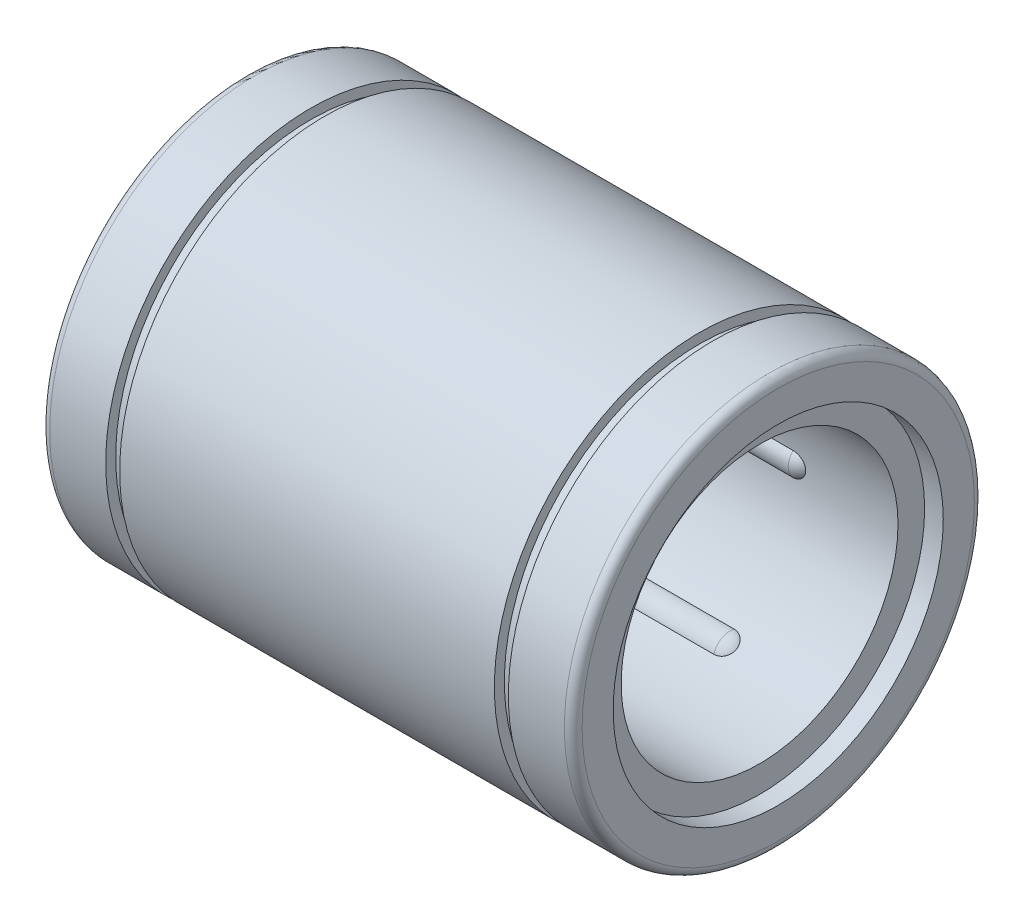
ISO-10303-21;
HEADER;
FILE_DESCRIPTION(('STEP AP214'),'2;1');
FILE_NAME('part.step','',(''),(''),'','','');
FILE_SCHEMA(('AUTOMOTIVE_DESIGN { 1 0 10303 214 1 1 1 1 }'));
ENDSEC;
DATA;
#1=APPLICATION_CONTEXT('core data for automotive mechanical design processes');
#2=APPLICATION_PROTOCOL_DEFINITION('international standard','automotive_design',2000,#1);
#3=PRODUCT_CONTEXT('',#1,'mechanical');
#4=PRODUCT('Part','Part','',(#3));
#5=PRODUCT_RELATED_PRODUCT_CATEGORY('part','',(#4));
#6=PRODUCT_DEFINITION_FORMATION('','',#4);
#7=PRODUCT_DEFINITION_CONTEXT('part definition',#1,'design');
#8=PRODUCT_DEFINITION('design','',#6,#7);
#9=PRODUCT_DEFINITION_SHAPE('','',#8);
#10=(LENGTH_UNIT() NAMED_UNIT(*) SI_UNIT(.MILLI.,.METRE.));
#11=(NAMED_UNIT(*) PLANE_ANGLE_UNIT() SI_UNIT($,.RADIAN.));
#12=(NAMED_UNIT(*) SI_UNIT($,.STERADIAN.) SOLID_ANGLE_UNIT());
#13=UNCERTAINTY_MEASURE_WITH_UNIT(LENGTH_MEASURE(1.E-05),#10,'distance_accuracy_value','');
#14=(GEOMETRIC_REPRESENTATION_CONTEXT(3) GLOBAL_UNCERTAINTY_ASSIGNED_CONTEXT((#13)) GLOBAL_UNIT_ASSIGNED_CONTEXT((#10,
#11,#12)) REPRESENTATION_CONTEXT('',''));
#15=CARTESIAN_POINT('',(0.,0.,0.));
#16=DIRECTION('',(0.,0.,1.));
#17=DIRECTION('',(1.,0.,0.));
#18=AXIS2_PLACEMENT_3D('',#15,#16,#17);
#19=CARTESIAN_POINT('',(61.5,-19.4855715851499,11.25));
#20=DIRECTION('',(1.,0.,0.));
#21=DIRECTION('',(0.,-0.866025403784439,0.5));
#22=AXIS2_PLACEMENT_3D('',#19,#20,#21);
#23=SPHERICAL_SURFACE('',#22,2.5);
#24=CARTESIAN_POINT('',(61.5,-19.4855715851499,11.25));
#25=DIRECTION('',(1.,0.,0.));
#26=DIRECTION('',(0.,0.,-1.));
#27=AXIS2_PLACEMENT_3D('',#24,#25,#26);
#28=CIRCLE('',#27,2.5);
#29=CARTESIAN_POINT('',(61.5,-17.0682450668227,11.8875990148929));
#30=VERTEX_POINT('',#29);
#31=CARTESIAN_POINT('',(61.5,-18.8290852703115,8.83773431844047));
#32=VERTEX_POINT('',#31);
#33=EDGE_CURVE('E123',#30,#32,#28,.F.);
#34=ORIENTED_EDGE('',*,*,#33,.F.);
#35=CARTESIAN_POINT('',(61.5,-17.0682450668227,11.8875990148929));
#36=CARTESIAN_POINT('',(61.5526065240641,-17.0682449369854,11.8875972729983));
#37=CARTESIAN_POINT('',(61.6051887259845,-17.0694914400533,11.8858096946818));
#38=CARTESIAN_POINT('',(61.7099938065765,-17.0744625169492,11.8786681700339));
#39=CARTESIAN_POINT('',(61.7622166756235,-17.0781871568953,11.8733141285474));
#40=CARTESIAN_POINT('',(61.9178256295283,-17.0930505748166,11.8519173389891));
#41=CARTESIAN_POINT('',(62.0202037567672,-17.1078788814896,11.8305399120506));
#42=CARTESIAN_POINT('',(62.2192191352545,-17.14690585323,11.7739029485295));
#43=CARTESIAN_POINT('',(62.3158517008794,-17.1711120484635,11.738632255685));
#44=CARTESIAN_POINT('',(62.5004532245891,-17.2280828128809,11.6548581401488));
#45=CARTESIAN_POINT('',(62.588426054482,-17.2608435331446,11.6063606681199));
#46=CARTESIAN_POINT('',(62.7522038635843,-17.3334667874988,11.4976150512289));
#47=CARTESIAN_POINT('',(62.8281128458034,-17.3732615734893,11.4374785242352));
#48=CARTESIAN_POINT('',(62.9661939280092,-17.4587624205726,11.3065339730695));
#49=CARTESIAN_POINT('',(63.0283661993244,-17.5044684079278,11.2357260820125));
#50=CARTESIAN_POINT('',(63.1346585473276,-17.5983071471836,11.0881436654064));
#51=CARTESIAN_POINT('',(63.1793745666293,-17.6462817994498,11.0116978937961));
#52=CARTESIAN_POINT('',(63.2524053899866,-17.7445140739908,10.8526925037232));
#53=CARTESIAN_POINT('',(63.2807252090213,-17.7947709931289,10.7701347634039));
#54=CARTESIAN_POINT('',(63.3192048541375,-17.8940267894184,10.6043763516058));
#55=CARTESIAN_POINT('',(63.3299848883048,-17.9430053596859,10.5213071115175));
#56=CARTESIAN_POINT('',(63.3349549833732,-18.0399977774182,10.3541206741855));
#57=CARTESIAN_POINT('',(63.3291468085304,-18.0880117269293,10.2700035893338));
#58=CARTESIAN_POINT('',(63.3013847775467,-18.1809196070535,10.1046037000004));
#59=CARTESIAN_POINT('',(63.2797012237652,-18.2258521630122,10.0232970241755));
#60=CARTESIAN_POINT('',(63.221249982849,-18.3123327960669,9.86441375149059));
#61=CARTESIAN_POINT('',(63.1844819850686,-18.3538808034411,9.78683723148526));
#62=CARTESIAN_POINT('',(63.0965734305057,-18.4331219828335,9.63676765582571));
#63=CARTESIAN_POINT('',(63.0452875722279,-18.4707706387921,9.56433576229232));
#64=CARTESIAN_POINT('',(62.9590134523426,-18.523412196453,9.4617487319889));
#65=CARTESIAN_POINT('',(62.9286893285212,-18.5403244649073,9.42855584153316));
#66=CARTESIAN_POINT('',(62.8651122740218,-18.5728385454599,9.36434524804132));
#67=CARTESIAN_POINT('',(62.8318569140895,-18.5884392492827,9.33332938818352));
#68=CARTESIAN_POINT('',(62.7259394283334,-18.634084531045,9.24205688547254));
#69=CARTESIAN_POINT('',(62.648889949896,-18.6618998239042,9.18567568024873));
#70=CARTESIAN_POINT('',(62.4856509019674,-18.7112976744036,9.08463107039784));
#71=CARTESIAN_POINT('',(62.3994589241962,-18.7328785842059,9.03997076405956));
#72=CARTESIAN_POINT('',(62.2633817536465,-18.7607897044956,8.98182891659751));
#73=CARTESIAN_POINT('',(62.2159153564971,-18.7694694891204,8.96366813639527));
#74=CARTESIAN_POINT('',(62.1195378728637,-18.7850731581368,8.93092117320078));
#75=CARTESIAN_POINT('',(62.0706280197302,-18.7919984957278,8.91633203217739));
#76=CARTESIAN_POINT('',(61.9222192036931,-18.8101214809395,8.8780716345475));
#77=CARTESIAN_POINT('',(61.8208893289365,-18.8186968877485,8.85984281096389));
#78=CARTESIAN_POINT('',(61.6824156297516,-18.8255145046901,8.84533840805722));
#79=CARTESIAN_POINT('',(61.6459699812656,-18.8268546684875,8.84248529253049));
#80=CARTESIAN_POINT('',(61.5730227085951,-18.828638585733,8.83868626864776));
#81=CARTESIAN_POINT('',(61.5365213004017,-18.8290839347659,8.83773696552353));
#82=CARTESIAN_POINT('',(61.5,-18.8290852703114,8.83773431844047));
#83=B_SPLINE_CURVE_WITH_KNOTS('',3,(#35,#36,#37,#38,#39,#40,#41,#42,#43,#44,#45,#46,#47,#48,#49,
#50,#51,#52,#53,#54,#55,#56,#57,#58,#59,#60,#61,#62,#63,#64,#65,#66,#67,#68,#69,#70,#71,#72,#73,
#74,#75,#76,#77,#78,#79,#80,#81,#82),.UNSPECIFIED.,.F.,.F.,(4,2,2,2,2,2,2,2,2,2,2,2,2,2,2,2,2,2,
2,2,2,2,2,4),(0.,0.157725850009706,0.315455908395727,0.63076284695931,0.946323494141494,
1.26174240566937,1.57427426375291,1.88680222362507,2.18746031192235,2.48802639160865,
2.77771332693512,3.06736945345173,3.35220517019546,3.63704675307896,3.9248465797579,
4.0688166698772,4.21290721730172,4.50981755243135,4.8068062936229,4.96132092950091,
5.11570716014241,5.42398223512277,5.53368705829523,5.64319608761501),.UNSPECIFIED.);
#84=EDGE_CURVE('E126',#30,#32,#83,.T.);
#85=ORIENTED_EDGE('',*,*,#84,.T.);
#86=EDGE_LOOP('',(#34,#85));
#87=FACE_BOUND('',#86,.T.);
#88=ADVANCED_FACE('F16',(#87),#23,.T.);
#89=CARTESIAN_POINT('',(40.,-19.4855715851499,11.25));
#90=DIRECTION('',(1.,0.,0.));
#91=DIRECTION('',(0.,0.,-1.));
#92=AXIS2_PLACEMENT_3D('',#89,#90,#91);
#93=CYLINDRICAL_SURFACE('',#92,2.5);
#94=DIRECTION('',(1.,0.,0.));
#95=VECTOR('',#94,1.);
#96=CARTESIAN_POINT('',(40.,-18.8290852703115,8.83773431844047));
#97=LINE('',#96,#95);
#98=CARTESIAN_POINT('',(18.5,-18.8290852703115,8.83773431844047));
#99=VERTEX_POINT('',#98);
#100=EDGE_CURVE('E130',#32,#99,#97,.F.);
#101=ORIENTED_EDGE('',*,*,#100,.T.);
#102=CARTESIAN_POINT('',(18.5,-19.4855715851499,11.25));
#103=DIRECTION('',(1.,0.,0.));
#104=DIRECTION('',(0.,-0.866025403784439,0.5));
#105=AXIS2_PLACEMENT_3D('',#102,#103,#104);
#106=CIRCLE('',#105,2.5);
#107=CARTESIAN_POINT('',(18.5,-17.0682450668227,11.8875990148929));
#108=VERTEX_POINT('',#107);
#109=EDGE_CURVE('E136',#108,#99,#106,.F.);
#110=ORIENTED_EDGE('',*,*,#109,.F.);
#111=DIRECTION('',(1.,0.,0.));
#112=VECTOR('',#111,1.);
#113=CARTESIAN_POINT('',(40.,-17.0682450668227,11.8875990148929));
#114=LINE('',#113,#112);
#115=EDGE_CURVE('E131',#108,#30,#114,.T.);
#116=ORIENTED_EDGE('',*,*,#115,.T.);
#117=ORIENTED_EDGE('',*,*,#33,.T.);
#118=EDGE_LOOP('',(#101,#110,#116,#117));
#119=FACE_BOUND('',#118,.T.);
#120=ADVANCED_FACE('F134',(#119),#93,.T.);
#121=CARTESIAN_POINT('',(18.5,-19.4855715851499,11.25));
#122=DIRECTION('',(1.,0.,0.));
#123=DIRECTION('',(0.,-0.866025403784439,0.5));
#124=AXIS2_PLACEMENT_3D('',#121,#122,#123);
#125=SPHERICAL_SURFACE('',#124,2.5);
#126=CARTESIAN_POINT('',(18.5,-18.8290852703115,8.83773431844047));
#127=CARTESIAN_POINT('',(18.4473934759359,-18.8290836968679,8.83773507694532));
#128=CARTESIAN_POINT('',(18.3948112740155,-18.8281588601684,8.83970836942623));
#129=CARTESIAN_POINT('',(18.2900061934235,-18.8244596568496,8.84758421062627));
#130=CARTESIAN_POINT('',(18.2377833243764,-18.8216852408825,8.85348686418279));
#131=CARTESIAN_POINT('',(18.0821743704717,-18.8105867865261,8.87705735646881));
#132=CARTESIAN_POINT('',(17.9797962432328,-18.7994875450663,8.90058776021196));
#133=CARTESIAN_POINT('',(17.7807808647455,-18.7699519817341,8.96270459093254));
#134=CARTESIAN_POINT('',(17.6841482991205,-18.7515097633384,9.00130311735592));
#135=CARTESIAN_POINT('',(17.4995467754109,-18.7074446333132,9.09252830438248));
#136=CARTESIAN_POINT('',(17.411573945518,-18.6818249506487,9.14514865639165));
#137=CARTESIAN_POINT('',(17.2477961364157,-18.6239601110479,9.26241504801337));
#138=CARTESIAN_POINT('',(17.1718871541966,-18.5917777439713,9.32694660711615));
#139=CARTESIAN_POINT('',(17.0338060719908,-18.5211268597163,9.46646478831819));
#140=CARTESIAN_POINT('',(16.9716338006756,-18.4826584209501,9.54145128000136));
#141=CARTESIAN_POINT('',(16.8653414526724,-18.4017676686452,9.69650922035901));
#142=CARTESIAN_POINT('',(16.8206254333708,-18.359551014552,9.77627937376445));
#143=CARTESIAN_POINT('',(16.7475946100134,-18.2709644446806,9.94085371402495));
#144=CARTESIAN_POINT('',(16.7192747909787,-18.2245958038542,10.0256563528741));
#145=CARTESIAN_POINT('',(16.6807951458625,-18.1306727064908,10.1944935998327));
#146=CARTESIAN_POINT('',(16.6700151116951,-18.083221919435,10.2784449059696));
#147=CARTESIAN_POINT('',(16.6650450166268,-17.9869304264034,10.4460360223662));
#148=CARTESIAN_POINT('',(16.6708531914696,-17.9380898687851,10.5296758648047));
#149=CARTESIAN_POINT('',(16.6986152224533,-17.8413033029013,10.6928363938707));
#150=CARTESIAN_POINT('',(16.7202987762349,-17.7933559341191,10.7724024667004));
#151=CARTESIAN_POINT('',(16.778750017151,-17.6989993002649,10.9267385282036));
#152=CARTESIAN_POINT('',(16.8155180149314,-17.6525900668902,11.0015084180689));
#153=CARTESIAN_POINT('',(16.9034265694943,-17.56224659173,11.1451680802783));
#154=CARTESIAN_POINT('',(16.9547124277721,-17.5183430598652,11.2139887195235));
#155=CARTESIAN_POINT('',(17.0409865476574,-17.4558208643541,11.3108711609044));
#156=CARTESIAN_POINT('',(17.0713106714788,-17.4355311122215,11.3421140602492));
#157=CARTESIAN_POINT('',(17.1348877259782,-17.3961801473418,11.4023773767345));
#158=CARTESIAN_POINT('',(17.1681430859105,-17.3771199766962,11.4313959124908));
#159=CARTESIAN_POINT('',(17.2740605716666,-17.3208983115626,11.5165621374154));
#160=CARTESIAN_POINT('',(17.351110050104,-17.2859784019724,11.568841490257));
#161=CARTESIAN_POINT('',(17.5143490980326,-17.2231701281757,11.6621435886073));
#162=CARTESIAN_POINT('',(17.6005410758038,-17.1952836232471,11.703163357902));
#163=CARTESIAN_POINT('',(17.7366182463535,-17.1588868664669,11.756406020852));
#164=CARTESIAN_POINT('',(17.7840846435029,-17.1474990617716,11.7730033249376));
#165=CARTESIAN_POINT('',(17.8804621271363,-17.1269411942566,11.8028899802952));
#166=CARTESIAN_POINT('',(17.9293719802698,-17.1177692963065,11.8161820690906));
#167=CARTESIAN_POINT('',(18.0777807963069,-17.0936963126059,11.8510072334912));
#168=CARTESIAN_POINT('',(18.1791106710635,-17.0821973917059,11.8675481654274));
#169=CARTESIAN_POINT('',(18.3175843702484,-17.0730450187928,11.8807045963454));
#170=CARTESIAN_POINT('',(18.3540300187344,-17.0712442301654,11.8832917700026));
#171=CARTESIAN_POINT('',(18.4269772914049,-17.0688461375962,11.8867361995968));
#172=CARTESIAN_POINT('',(18.4634786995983,-17.0682466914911,11.8875965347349));
#173=CARTESIAN_POINT('',(18.5,-17.0682450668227,11.8875990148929));
#174=B_SPLINE_CURVE_WITH_KNOTS('',3,(#126,#127,#128,#129,#130,#131,#132,#133,#134,#135,#136,
#137,#138,#139,#140,#141,#142,#143,#144,#145,#146,#147,#148,#149,#150,#151,#152,#153,#154,#155,
#156,#157,#158,#159,#160,#161,#162,#163,#164,#165,#166,#167,#168,#169,#170,#171,#172,#173),
.UNSPECIFIED.,.F.,.F.,(4,2,2,2,2,2,2,2,2,2,2,2,2,2,2,2,2,2,2,2,2,2,2,4),(0.,0.157725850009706,
0.315455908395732,0.630762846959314,0.946323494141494,1.26174240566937,1.5742742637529,
1.88680222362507,2.18746031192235,2.48802639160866,2.77771332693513,3.06736945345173,
3.35220517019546,3.63704675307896,3.92484657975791,4.0688166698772,4.21290721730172,
4.50981755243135,4.8068062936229,4.96132092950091,5.11570716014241,5.42398223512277,
5.53368705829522,5.64319608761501),.UNSPECIFIED.);
#175=EDGE_CURVE('E141',#99,#108,#174,.T.);
#176=ORIENTED_EDGE('',*,*,#175,.T.);
#177=ORIENTED_EDGE('',*,*,#109,.T.);
#178=EDGE_LOOP('',(#176,#177));
#179=FACE_BOUND('',#178,.T.);
#180=ADVANCED_FACE('F625',(#179),#125,.T.);
#181=CARTESIAN_POINT('',(61.5,0.,22.5));
#182=DIRECTION('',(1.,0.,0.));
#183=DIRECTION('',(0.,0.,1.));
#184=AXIS2_PLACEMENT_3D('',#181,#182,#183);
#185=SPHERICAL_SURFACE('',#184,2.5);
#186=CARTESIAN_POINT('',(61.5,0.,22.5));
#187=DIRECTION('',(1.,0.,0.));
#188=DIRECTION('',(0.,0.,-1.));
#189=AXIS2_PLACEMENT_3D('',#186,#187,#188);
#190=CIRCLE('',#189,2.5);
#191=CARTESIAN_POINT('',(61.5,1.76084020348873,20.7253333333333));
#192=VERTEX_POINT('',#191);
#193=CARTESIAN_POINT('',(61.5,-1.76084020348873,20.7253333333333));
#194=VERTEX_POINT('',#193);
#195=EDGE_CURVE('E483',#192,#194,#190,.F.);
#196=ORIENTED_EDGE('',*,*,#195,.F.);
#197=CARTESIAN_POINT('',(61.5,1.76084020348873,20.7253333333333));
#198=CARTESIAN_POINT('',(61.5526065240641,1.76083875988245,20.7253323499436));
#199=CARTESIAN_POINT('',(61.6051887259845,1.75866742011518,20.725518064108));
#200=CARTESIAN_POINT('',(61.7099938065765,1.74999713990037,20.7262523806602));
#201=CARTESIAN_POINT('',(61.7622166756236,1.74349808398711,20.7268009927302));
#202=CARTESIAN_POINT('',(61.9178256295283,1.71753621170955,20.7289746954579));
#203=CARTESIAN_POINT('',(62.0202037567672,1.69160866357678,20.7311276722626));
#204=CARTESIAN_POINT('',(62.2192191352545,1.62304612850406,20.7366075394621));
#205=CARTESIAN_POINT('',(62.3158517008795,1.58039771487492,20.7399353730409));
#206=CARTESIAN_POINT('',(62.5004532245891,1.47936182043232,20.7473864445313));
#207=CARTESIAN_POINT('',(62.588426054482,1.42098141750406,20.7515093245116));
#208=CARTESIAN_POINT('',(62.7522038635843,1.29049332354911,20.7600300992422));
#209=CARTESIAN_POINT('',(62.8281128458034,1.21851617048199,20.7644251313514));
#210=CARTESIAN_POINT('',(62.9661939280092,1.06236443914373,20.7729987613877));
#211=CARTESIAN_POINT('',(63.0283661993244,0.978190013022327,20.7771773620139));
#212=CARTESIAN_POINT('',(63.1346585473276,0.803460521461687,20.7846528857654));
#213=CARTESIAN_POINT('',(63.1793745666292,0.713269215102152,20.7879772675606));
#214=CARTESIAN_POINT('',(63.2524053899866,0.526450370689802,20.7935462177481));
#215=CARTESIAN_POINT('',(63.2807252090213,0.429824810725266,20.795791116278));
#216=CARTESIAN_POINT('',(63.3192048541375,0.236645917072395,20.7988699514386));
#217=CARTESIAN_POINT('',(63.3299848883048,0.140216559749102,20.7997520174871));
#218=CARTESIAN_POINT('',(63.3349549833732,-0.0530673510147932,20.8001566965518));
#219=CARTESIAN_POINT('',(63.3291468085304,-0.149921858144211,20.7996794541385));
#220=CARTESIAN_POINT('',(63.3013847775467,-0.339616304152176,20.7974400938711));
#221=CARTESIAN_POINT('',(63.2797012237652,-0.432496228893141,20.7956994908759));
#222=CARTESIAN_POINT('',(63.221249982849,-0.613333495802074,20.7911522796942));
#223=CARTESIAN_POINT('',(63.1844819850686,-0.701290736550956,20.7883456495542));
#224=CARTESIAN_POINT('',(63.0965734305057,-0.870875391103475,20.781935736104));
#225=CARTESIAN_POINT('',(63.0452875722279,-0.952427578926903,20.7783244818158));
#226=CARTESIAN_POINT('',(62.9590134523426,-1.06759133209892,20.7726198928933));
#227=CARTESIAN_POINT('',(62.9286893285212,-1.10479335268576,20.7706699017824));
#228=CARTESIAN_POINT('',(62.8651122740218,-1.1766583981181,20.7667226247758));
#229=CARTESIAN_POINT('',(62.8318569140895,-1.21131927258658,20.7647253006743));
#230=CARTESIAN_POINT('',(62.7259394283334,-1.31318621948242,20.7586190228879));
#231=CARTESIAN_POINT('',(62.648889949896,-1.37592142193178,20.7545171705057));
#232=CARTESIAN_POINT('',(62.4856509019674,-1.48812754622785,20.7467746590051));
#233=CARTESIAN_POINT('',(62.3994589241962,-1.53759496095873,20.7431341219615));
#234=CARTESIAN_POINT('',(62.2633817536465,-1.60190283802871,20.7382349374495));
#235=CARTESIAN_POINT('',(62.2159153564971,-1.62197042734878,20.7366714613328));
#236=CARTESIAN_POINT('',(62.1195378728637,-1.65813196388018,20.733811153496));
#237=CARTESIAN_POINT('',(62.0706280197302,-1.67422919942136,20.7325141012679));
#238=CARTESIAN_POINT('',(61.9222192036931,-1.71642516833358,20.7290788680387));
#239=CARTESIAN_POINT('',(61.8208893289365,-1.73649949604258,20.7273909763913));
#240=CARTESIAN_POINT('',(61.6824156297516,-1.75246948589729,20.7260430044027));
#241=CARTESIAN_POINT('',(61.6459699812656,-1.75561043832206,20.7257770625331));
#242=CARTESIAN_POINT('',(61.5730227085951,-1.75979244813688,20.7254224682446));
#243=CARTESIAN_POINT('',(61.5365213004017,-1.76083724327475,20.7253335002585));
#244=CARTESIAN_POINT('',(61.5,-1.76084020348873,20.7253333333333));
#245=B_SPLINE_CURVE_WITH_KNOTS('',3,(#197,#198,#199,#200,#201,#202,#203,#204,#205,#206,#207,
#208,#209,#210,#211,#212,#213,#214,#215,#216,#217,#218,#219,#220,#221,#222,#223,#224,#225,#226,
#227,#228,#229,#230,#231,#232,#233,#234,#235,#236,#237,#238,#239,#240,#241,#242,#243,#244),
.UNSPECIFIED.,.F.,.F.,(4,2,2,2,2,2,2,2,2,2,2,2,2,2,2,2,2,2,2,2,2,2,2,4),(0.,0.157725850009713,
0.315455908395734,0.630762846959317,0.946323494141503,1.26174240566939,1.57427426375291,
1.88680222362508,2.18746031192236,2.48802639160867,2.77771332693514,3.06736945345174,
3.35220517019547,3.63704675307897,3.92484657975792,4.06881666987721,4.21290721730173,
4.50981755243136,4.80680629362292,4.96132092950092,5.11570716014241,5.42398223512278,
5.53368705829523,5.64319608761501),.UNSPECIFIED.);
#246=EDGE_CURVE('E379',#192,#194,#245,.T.);
#247=ORIENTED_EDGE('',*,*,#246,.T.);
#248=EDGE_LOOP('',(#196,#247));
#249=FACE_BOUND('',#248,.T.);
#250=ADVANCED_FACE('F622',(#249),#185,.T.);
#251=CARTESIAN_POINT('',(40.,0.,22.5));
#252=DIRECTION('',(1.,0.,0.));
#253=DIRECTION('',(0.,0.,-1.));
#254=AXIS2_PLACEMENT_3D('',#251,#252,#253);
#255=CYLINDRICAL_SURFACE('',#254,2.5);
#256=DIRECTION('',(1.,0.,0.));
#257=VECTOR('',#256,1.);
#258=CARTESIAN_POINT('',(40.,-1.76084020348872,20.7253333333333));
#259=LINE('',#258,#257);
#260=CARTESIAN_POINT('',(18.5,-1.76084020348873,20.7253333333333));
#261=VERTEX_POINT('',#260);
#262=EDGE_CURVE('E472',#194,#261,#259,.F.);
#263=ORIENTED_EDGE('',*,*,#262,.T.);
#264=CARTESIAN_POINT('',(18.5,0.,22.5));
#265=DIRECTION('',(1.,0.,0.));
#266=DIRECTION('',(0.,0.,1.));
#267=AXIS2_PLACEMENT_3D('',#264,#265,#266);
#268=CIRCLE('',#267,2.5);
#269=CARTESIAN_POINT('',(18.5,1.76084020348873,20.7253333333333));
#270=VERTEX_POINT('',#269);
#271=EDGE_CURVE('E484',#270,#261,#268,.F.);
#272=ORIENTED_EDGE('',*,*,#271,.F.);
#273=DIRECTION('',(1.,0.,0.));
#274=VECTOR('',#273,1.);
#275=CARTESIAN_POINT('',(40.,1.76084020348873,20.7253333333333));
#276=LINE('',#275,#274);
#277=EDGE_CURVE('E143',#270,#192,#276,.T.);
#278=ORIENTED_EDGE('',*,*,#277,.T.);
#279=ORIENTED_EDGE('',*,*,#195,.T.);
#280=EDGE_LOOP('',(#263,#272,#278,#279));
#281=FACE_BOUND('',#280,.T.);
#282=ADVANCED_FACE('F482',(#281),#255,.T.);
#283=CARTESIAN_POINT('',(18.5,0.,22.5));
#284=DIRECTION('',(1.,0.,0.));
#285=DIRECTION('',(0.,0.,1.));
#286=AXIS2_PLACEMENT_3D('',#283,#284,#285);
#287=SPHERICAL_SURFACE('',#286,2.5);
#288=CARTESIAN_POINT('',(18.5,-1.76084020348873,20.7253333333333));
#289=CARTESIAN_POINT('',(18.4473934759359,-1.76083875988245,20.7253323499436));
#290=CARTESIAN_POINT('',(18.3948112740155,-1.75866742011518,20.725518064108));
#291=CARTESIAN_POINT('',(18.2900061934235,-1.74999713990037,20.7262523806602));
#292=CARTESIAN_POINT('',(18.2377833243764,-1.74349808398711,20.7268009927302));
#293=CARTESIAN_POINT('',(18.0821743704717,-1.71753621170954,20.7289746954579));
#294=CARTESIAN_POINT('',(17.9797962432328,-1.69160866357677,20.7311276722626));
#295=CARTESIAN_POINT('',(17.7807808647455,-1.62304612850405,20.7366075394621));
#296=CARTESIAN_POINT('',(17.6841482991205,-1.58039771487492,20.7399353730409));
#297=CARTESIAN_POINT('',(17.4995467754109,-1.47936182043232,20.7473864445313));
#298=CARTESIAN_POINT('',(17.411573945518,-1.42098141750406,20.7515093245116));
#299=CARTESIAN_POINT('',(17.2477961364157,-1.29049332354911,20.7600300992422));
#300=CARTESIAN_POINT('',(17.1718871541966,-1.218516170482,20.7644251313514));
#301=CARTESIAN_POINT('',(17.0338060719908,-1.06236443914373,20.7729987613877));
#302=CARTESIAN_POINT('',(16.9716338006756,-0.978190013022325,20.7771773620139));
#303=CARTESIAN_POINT('',(16.8653414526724,-0.803460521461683,20.7846528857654));
#304=CARTESIAN_POINT('',(16.8206254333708,-0.713269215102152,20.7879772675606));
#305=CARTESIAN_POINT('',(16.7475946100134,-0.526450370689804,20.7935462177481));
#306=CARTESIAN_POINT('',(16.7192747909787,-0.429824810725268,20.795791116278));
#307=CARTESIAN_POINT('',(16.6807951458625,-0.236645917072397,20.7988699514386));
#308=CARTESIAN_POINT('',(16.6700151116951,-0.140216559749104,20.7997520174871));
#309=CARTESIAN_POINT('',(16.6650450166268,0.0530673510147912,20.8001566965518));
#310=CARTESIAN_POINT('',(16.6708531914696,0.14992185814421,20.7996794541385));
#311=CARTESIAN_POINT('',(16.6986152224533,0.339616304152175,20.7974400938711));
#312=CARTESIAN_POINT('',(16.7202987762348,0.432496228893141,20.7956994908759));
#313=CARTESIAN_POINT('',(16.778750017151,0.613333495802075,20.7911522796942));
#314=CARTESIAN_POINT('',(16.8155180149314,0.701290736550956,20.7883456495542));
#315=CARTESIAN_POINT('',(16.9034265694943,0.870875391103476,20.781935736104));
#316=CARTESIAN_POINT('',(16.9547124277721,0.952427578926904,20.7783244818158));
#317=CARTESIAN_POINT('',(17.0409865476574,1.06759133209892,20.7726198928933));
#318=CARTESIAN_POINT('',(17.0713106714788,1.10479335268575,20.7706699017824));
#319=CARTESIAN_POINT('',(17.1348877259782,1.17665839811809,20.7667226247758));
#320=CARTESIAN_POINT('',(17.1681430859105,1.21131927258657,20.7647253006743));
#321=CARTESIAN_POINT('',(17.2740605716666,1.31318621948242,20.7586190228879));
#322=CARTESIAN_POINT('',(17.351110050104,1.37592142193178,20.7545171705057));
#323=CARTESIAN_POINT('',(17.5143490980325,1.48812754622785,20.7467746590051));
#324=CARTESIAN_POINT('',(17.6005410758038,1.53759496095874,20.7431341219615));
#325=CARTESIAN_POINT('',(17.7366182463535,1.60190283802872,20.7382349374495));
#326=CARTESIAN_POINT('',(17.7840846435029,1.62197042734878,20.7366714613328));
#327=CARTESIAN_POINT('',(17.8804621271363,1.65813196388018,20.733811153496));
#328=CARTESIAN_POINT('',(17.9293719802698,1.67422919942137,20.7325141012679));
#329=CARTESIAN_POINT('',(18.0777807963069,1.71642516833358,20.7290788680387));
#330=CARTESIAN_POINT('',(18.1791106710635,1.73649949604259,20.7273909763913));
#331=CARTESIAN_POINT('',(18.3175843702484,1.7524694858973,20.7260430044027));
#332=CARTESIAN_POINT('',(18.3540300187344,1.75561043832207,20.7257770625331));
#333=CARTESIAN_POINT('',(18.4269772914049,1.75979244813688,20.7254224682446));
#334=CARTESIAN_POINT('',(18.4634786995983,1.76083724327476,20.7253335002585));
#335=CARTESIAN_POINT('',(18.5,1.76084020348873,20.7253333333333));
#336=B_SPLINE_CURVE_WITH_KNOTS('',3,(#288,#289,#290,#291,#292,#293,#294,#295,#296,#297,#298,
#299,#300,#301,#302,#303,#304,#305,#306,#307,#308,#309,#310,#311,#312,#313,#314,#315,#316,#317,
#318,#319,#320,#321,#322,#323,#324,#325,#326,#327,#328,#329,#330,#331,#332,#333,#334,#335),
.UNSPECIFIED.,.F.,.F.,(4,2,2,2,2,2,2,2,2,2,2,2,2,2,2,2,2,2,2,2,2,2,2,4),(0.,0.157725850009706,
0.315455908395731,0.630762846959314,0.946323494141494,1.26174240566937,1.5742742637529,
1.88680222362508,2.18746031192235,2.48802639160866,2.77771332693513,3.06736945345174,
3.35220517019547,3.63704675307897,3.92484657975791,4.06881666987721,4.21290721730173,
4.50981755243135,4.80680629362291,4.96132092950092,5.11570716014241,5.42398223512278,
5.53368705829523,5.64319608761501),.UNSPECIFIED.);
#337=EDGE_CURVE('E372',#261,#270,#336,.T.);
#338=ORIENTED_EDGE('',*,*,#337,.T.);
#339=ORIENTED_EDGE('',*,*,#271,.T.);
#340=EDGE_LOOP('',(#338,#339));
#341=FACE_BOUND('',#340,.T.);
#342=ADVANCED_FACE('F488',(#341),#287,.T.);
#343=CARTESIAN_POINT('',(61.5,19.4855715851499,11.25));
#344=DIRECTION('',(1.,0.,0.));
#345=DIRECTION('',(0.,0.866025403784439,0.5));
#346=AXIS2_PLACEMENT_3D('',#343,#344,#345);
#347=SPHERICAL_SURFACE('',#346,2.5);
#348=CARTESIAN_POINT('',(61.5,19.4855715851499,11.25));
#349=DIRECTION('',(1.,0.,0.));
#350=DIRECTION('',(0.,0.,-1.));
#351=AXIS2_PLACEMENT_3D('',#348,#349,#350);
#352=CIRCLE('',#351,2.5);
#353=CARTESIAN_POINT('',(61.5,18.8290852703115,8.83773431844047));
#354=VERTEX_POINT('',#353);
#355=CARTESIAN_POINT('',(61.5,17.0682450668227,11.8875990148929));
#356=VERTEX_POINT('',#355);
#357=EDGE_CURVE('E489',#354,#356,#352,.F.);
#358=ORIENTED_EDGE('',*,*,#357,.F.);
#359=CARTESIAN_POINT('',(61.5,18.8290852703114,8.83773431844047));
#360=CARTESIAN_POINT('',(61.5526065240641,18.8290836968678,8.83773507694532));
#361=CARTESIAN_POINT('',(61.6051887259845,18.8281588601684,8.83970836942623));
#362=CARTESIAN_POINT('',(61.7099938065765,18.8244596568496,8.84758421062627));
#363=CARTESIAN_POINT('',(61.7622166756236,18.8216852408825,8.85348686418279));
#364=CARTESIAN_POINT('',(61.9178256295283,18.8105867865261,8.87705735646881));
#365=CARTESIAN_POINT('',(62.0202037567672,18.7994875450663,8.90058776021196));
#366=CARTESIAN_POINT('',(62.2192191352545,18.7699519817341,8.96270459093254));
#367=CARTESIAN_POINT('',(62.3158517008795,18.7515097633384,9.00130311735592));
#368=CARTESIAN_POINT('',(62.5004532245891,18.7074446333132,9.09252830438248));
#369=CARTESIAN_POINT('',(62.588426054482,18.6818249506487,9.14514865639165));
#370=CARTESIAN_POINT('',(62.7522038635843,18.6239601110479,9.26241504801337));
#371=CARTESIAN_POINT('',(62.8281128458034,18.5917777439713,9.32694660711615));
#372=CARTESIAN_POINT('',(62.9661939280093,18.5211268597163,9.4664647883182));
#373=CARTESIAN_POINT('',(63.0283661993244,18.4826584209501,9.54145128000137));
#374=CARTESIAN_POINT('',(63.1346585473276,18.4017676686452,9.69650922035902));
#375=CARTESIAN_POINT('',(63.1793745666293,18.359551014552,9.77627937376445));
#376=CARTESIAN_POINT('',(63.2524053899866,18.2709644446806,9.94085371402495));
#377=CARTESIAN_POINT('',(63.2807252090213,18.2245958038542,10.0256563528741));
#378=CARTESIAN_POINT('',(63.3192048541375,18.1306727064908,10.1944935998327));
#379=CARTESIAN_POINT('',(63.3299848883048,18.083221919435,10.2784449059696));
#380=CARTESIAN_POINT('',(63.3349549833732,17.9869304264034,10.4460360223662));
#381=CARTESIAN_POINT('',(63.3291468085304,17.9380898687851,10.5296758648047));
#382=CARTESIAN_POINT('',(63.3013847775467,17.8413033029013,10.6928363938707));
#383=CARTESIAN_POINT('',(63.2797012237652,17.7933559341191,10.7724024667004));
#384=CARTESIAN_POINT('',(63.221249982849,17.6989993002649,10.9267385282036));
#385=CARTESIAN_POINT('',(63.1844819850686,17.6525900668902,11.0015084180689));
#386=CARTESIAN_POINT('',(63.0965734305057,17.56224659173,11.1451680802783));
#387=CARTESIAN_POINT('',(63.0452875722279,17.5183430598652,11.2139887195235));
#388=CARTESIAN_POINT('',(62.9590134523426,17.4558208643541,11.3108711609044));
#389=CARTESIAN_POINT('',(62.9286893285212,17.4355311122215,11.3421140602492));
#390=CARTESIAN_POINT('',(62.8651122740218,17.3961801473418,11.4023773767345));
#391=CARTESIAN_POINT('',(62.8318569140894,17.3771199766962,11.4313959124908));
#392=CARTESIAN_POINT('',(62.7259394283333,17.3208983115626,11.5165621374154));
#393=CARTESIAN_POINT('',(62.648889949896,17.2859784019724,11.568841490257));
#394=CARTESIAN_POINT('',(62.4856509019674,17.2231701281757,11.6621435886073));
#395=CARTESIAN_POINT('',(62.3994589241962,17.1952836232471,11.703163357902));
#396=CARTESIAN_POINT('',(62.2633817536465,17.1588868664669,11.756406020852));
#397=CARTESIAN_POINT('',(62.215915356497,17.1474990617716,11.7730033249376));
#398=CARTESIAN_POINT('',(62.1195378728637,17.1269411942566,11.8028899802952));
#399=CARTESIAN_POINT('',(62.0706280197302,17.1177692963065,11.8161820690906));
#400=CARTESIAN_POINT('',(61.9222192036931,17.0936963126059,11.8510072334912));
#401=CARTESIAN_POINT('',(61.8208893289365,17.0821973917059,11.8675481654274));
#402=CARTESIAN_POINT('',(61.6824156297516,17.0730450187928,11.8807045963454));
#403=CARTESIAN_POINT('',(61.6459699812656,17.0712442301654,11.8832917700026));
#404=CARTESIAN_POINT('',(61.5730227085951,17.0688461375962,11.8867361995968));
#405=CARTESIAN_POINT('',(61.5365213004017,17.0682466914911,11.8875965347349));
#406=CARTESIAN_POINT('',(61.5,17.0682450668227,11.8875990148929));
#407=B_SPLINE_CURVE_WITH_KNOTS('',3,(#359,#360,#361,#362,#363,#364,#365,#366,#367,#368,#369,
#370,#371,#372,#373,#374,#375,#376,#377,#378,#379,#380,#381,#382,#383,#384,#385,#386,#387,#388,
#389,#390,#391,#392,#393,#394,#395,#396,#397,#398,#399,#400,#401,#402,#403,#404,#405,#406),
.UNSPECIFIED.,.F.,.F.,(4,2,2,2,2,2,2,2,2,2,2,2,2,2,2,2,2,2,2,2,2,2,2,4),(0.,0.157725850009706,
0.315455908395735,0.630762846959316,0.946323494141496,1.26174240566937,1.57427426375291,
1.88680222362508,2.18746031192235,2.48802639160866,2.77771332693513,3.06736945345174,
3.35220517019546,3.63704675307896,3.92484657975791,4.0688166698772,4.21290721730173,
4.50981755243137,4.80680629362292,4.96132092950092,5.11570716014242,5.42398223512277,
5.53368705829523,5.64319608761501),.UNSPECIFIED.);
#408=EDGE_CURVE('E364',#354,#356,#407,.T.);
#409=ORIENTED_EDGE('',*,*,#408,.T.);
#410=EDGE_LOOP('',(#358,#409));
#411=FACE_BOUND('',#410,.T.);
#412=ADVANCED_FACE('F505',(#411),#347,.T.);
#413=CARTESIAN_POINT('',(40.,19.4855715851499,11.25));
#414=DIRECTION('',(1.,0.,0.));
#415=DIRECTION('',(0.,0.,-1.));
#416=AXIS2_PLACEMENT_3D('',#413,#414,#415);
#417=CYLINDRICAL_SURFACE('',#416,2.5);
#418=DIRECTION('',(1.,0.,0.));
#419=VECTOR('',#418,1.);
#420=CARTESIAN_POINT('',(40.,17.0682450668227,11.8875990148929));
#421=LINE('',#420,#419);
#422=CARTESIAN_POINT('',(18.5,17.0682450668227,11.8875990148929));
#423=VERTEX_POINT('',#422);
#424=EDGE_CURVE('E468',#356,#423,#421,.F.);
#425=ORIENTED_EDGE('',*,*,#424,.T.);
#426=CARTESIAN_POINT('',(18.5,19.4855715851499,11.25));
#427=DIRECTION('',(1.,0.,0.));
#428=DIRECTION('',(0.,0.866025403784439,0.5));
#429=AXIS2_PLACEMENT_3D('',#426,#427,#428);
#430=CIRCLE('',#429,2.5);
#431=CARTESIAN_POINT('',(18.5,18.8290852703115,8.83773431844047));
#432=VERTEX_POINT('',#431);
#433=EDGE_CURVE('E492',#432,#423,#430,.F.);
#434=ORIENTED_EDGE('',*,*,#433,.F.);
#435=DIRECTION('',(1.,0.,0.));
#436=VECTOR('',#435,1.);
#437=CARTESIAN_POINT('',(40.,18.8290852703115,8.83773431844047));
#438=LINE('',#437,#436);
#439=EDGE_CURVE('E470',#432,#354,#438,.T.);
#440=ORIENTED_EDGE('',*,*,#439,.T.);
#441=ORIENTED_EDGE('',*,*,#357,.T.);
#442=EDGE_LOOP('',(#425,#434,#440,#441));
#443=FACE_BOUND('',#442,.T.);
#444=ADVANCED_FACE('F509',(#443),#417,.T.);
#445=CARTESIAN_POINT('',(18.5,19.4855715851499,11.25));
#446=DIRECTION('',(1.,0.,0.));
#447=DIRECTION('',(0.,0.866025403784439,0.5));
#448=AXIS2_PLACEMENT_3D('',#445,#446,#447);
#449=SPHERICAL_SURFACE('',#448,2.5);
#450=CARTESIAN_POINT('',(18.5,17.0682450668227,11.8875990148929));
#451=CARTESIAN_POINT('',(18.4473934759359,17.0682449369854,11.8875972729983));
#452=CARTESIAN_POINT('',(18.3948112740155,17.0694914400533,11.8858096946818));
#453=CARTESIAN_POINT('',(18.2900061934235,17.0744625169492,11.8786681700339));
#454=CARTESIAN_POINT('',(18.2377833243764,17.0781871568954,11.8733141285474));
#455=CARTESIAN_POINT('',(18.0821743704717,17.0930505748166,11.8519173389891));
#456=CARTESIAN_POINT('',(17.9797962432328,17.1078788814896,11.8305399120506));
#457=CARTESIAN_POINT('',(17.7807808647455,17.14690585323,11.7739029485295));
#458=CARTESIAN_POINT('',(17.6841482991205,17.1711120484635,11.738632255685));
#459=CARTESIAN_POINT('',(17.4995467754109,17.2280828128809,11.6548581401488));
#460=CARTESIAN_POINT('',(17.411573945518,17.2608435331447,11.6063606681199));
#461=CARTESIAN_POINT('',(17.2477961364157,17.3334667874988,11.4976150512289));
#462=CARTESIAN_POINT('',(17.1718871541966,17.3732615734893,11.4374785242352));
#463=CARTESIAN_POINT('',(17.0338060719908,17.4587624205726,11.3065339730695));
#464=CARTESIAN_POINT('',(16.9716338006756,17.5044684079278,11.2357260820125));
#465=CARTESIAN_POINT('',(16.8653414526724,17.5983071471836,11.0881436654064));
#466=CARTESIAN_POINT('',(16.8206254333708,17.6462817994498,11.0116978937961));
#467=CARTESIAN_POINT('',(16.7475946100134,17.7445140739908,10.8526925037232));
#468=CARTESIAN_POINT('',(16.7192747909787,17.7947709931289,10.7701347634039));
#469=CARTESIAN_POINT('',(16.6807951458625,17.8940267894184,10.6043763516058));
#470=CARTESIAN_POINT('',(16.6700151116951,17.9430053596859,10.5213071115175));
#471=CARTESIAN_POINT('',(16.6650450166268,18.0399977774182,10.3541206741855));
#472=CARTESIAN_POINT('',(16.6708531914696,18.0880117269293,10.2700035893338));
#473=CARTESIAN_POINT('',(16.6986152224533,18.1809196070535,10.1046037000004));
#474=CARTESIAN_POINT('',(16.7202987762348,18.2258521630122,10.0232970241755));
#475=CARTESIAN_POINT('',(16.778750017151,18.3123327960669,9.86441375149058));
#476=CARTESIAN_POINT('',(16.8155180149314,18.3538808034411,9.78683723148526));
#477=CARTESIAN_POINT('',(16.9034265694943,18.4331219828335,9.63676765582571));
#478=CARTESIAN_POINT('',(16.9547124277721,18.4707706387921,9.56433576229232));
#479=CARTESIAN_POINT('',(17.0409865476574,18.523412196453,9.4617487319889));
#480=CARTESIAN_POINT('',(17.0713106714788,18.5403244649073,9.42855584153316));
#481=CARTESIAN_POINT('',(17.1348877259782,18.5728385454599,9.36434524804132));
#482=CARTESIAN_POINT('',(17.1681430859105,18.5884392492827,9.33332938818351));
#483=CARTESIAN_POINT('',(17.2740605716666,18.634084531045,9.24205688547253));
#484=CARTESIAN_POINT('',(17.351110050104,18.6618998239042,9.18567568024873));
#485=CARTESIAN_POINT('',(17.5143490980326,18.7112976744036,9.08463107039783));
#486=CARTESIAN_POINT('',(17.6005410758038,18.7328785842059,9.03997076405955));
#487=CARTESIAN_POINT('',(17.7366182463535,18.7607897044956,8.98182891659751));
#488=CARTESIAN_POINT('',(17.7840846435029,18.7694694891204,8.96366813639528));
#489=CARTESIAN_POINT('',(17.8804621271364,18.7850731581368,8.93092117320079));
#490=CARTESIAN_POINT('',(17.9293719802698,18.7919984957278,8.91633203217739));
#491=CARTESIAN_POINT('',(18.0777807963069,18.8101214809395,8.8780716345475));
#492=CARTESIAN_POINT('',(18.1791106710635,18.8186968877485,8.85984281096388));
#493=CARTESIAN_POINT('',(18.3175843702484,18.8255145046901,8.84533840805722));
#494=CARTESIAN_POINT('',(18.3540300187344,18.8268546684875,8.84248529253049));
#495=CARTESIAN_POINT('',(18.4269772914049,18.828638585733,8.83868626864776));
#496=CARTESIAN_POINT('',(18.4634786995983,18.8290839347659,8.83773696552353));
#497=CARTESIAN_POINT('',(18.5,18.8290852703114,8.83773431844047));
#498=B_SPLINE_CURVE_WITH_KNOTS('',3,(#450,#451,#452,#453,#454,#455,#456,#457,#458,#459,#460,
#461,#462,#463,#464,#465,#466,#467,#468,#469,#470,#471,#472,#473,#474,#475,#476,#477,#478,#479,
#480,#481,#482,#483,#484,#485,#486,#487,#488,#489,#490,#491,#492,#493,#494,#495,#496,#497),
.UNSPECIFIED.,.F.,.F.,(4,2,2,2,2,2,2,2,2,2,2,2,2,2,2,2,2,2,2,2,2,2,2,4),(0.,0.157725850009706,
0.315455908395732,0.630762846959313,0.946323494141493,1.26174240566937,1.5742742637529,
1.88680222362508,2.18746031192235,2.48802639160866,2.77771332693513,3.06736945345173,
3.35220517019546,3.63704675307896,3.9248465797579,4.06881666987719,4.21290721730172,
4.50981755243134,4.80680629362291,4.96132092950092,5.11570716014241,5.42398223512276,
5.53368705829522,5.643196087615),.UNSPECIFIED.);
#499=EDGE_CURVE('E171',#423,#432,#498,.T.);
#500=ORIENTED_EDGE('',*,*,#499,.T.);
#501=ORIENTED_EDGE('',*,*,#433,.T.);
#502=EDGE_LOOP('',(#500,#501));
#503=FACE_BOUND('',#502,.T.);
#504=ADVANCED_FACE('F514',(#503),#449,.T.);
#505=CARTESIAN_POINT('',(61.5,19.4855715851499,-11.25));
#506=DIRECTION('',(1.,0.,0.));
#507=DIRECTION('',(0.,0.866025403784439,-0.5));
#508=AXIS2_PLACEMENT_3D('',#505,#506,#507);
#509=SPHERICAL_SURFACE('',#508,2.5);
#510=CARTESIAN_POINT('',(61.5,19.4855715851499,-11.25));
#511=DIRECTION('',(1.,0.,0.));
#512=DIRECTION('',(0.,0.,-1.));
#513=AXIS2_PLACEMENT_3D('',#510,#511,#512);
#514=CIRCLE('',#513,2.5);
#515=CARTESIAN_POINT('',(61.5,17.0682450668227,-11.8875990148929));
#516=VERTEX_POINT('',#515);
#517=CARTESIAN_POINT('',(61.5,18.8290852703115,-8.83773431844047));
#518=VERTEX_POINT('',#517);
#519=EDGE_CURVE('E440',#516,#518,#514,.F.);
#520=ORIENTED_EDGE('',*,*,#519,.F.);
#521=CARTESIAN_POINT('',(61.5,17.0682450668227,-11.8875990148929));
#522=CARTESIAN_POINT('',(61.5526065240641,17.0682449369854,-11.8875972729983));
#523=CARTESIAN_POINT('',(61.6051887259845,17.0694914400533,-11.8858096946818));
#524=CARTESIAN_POINT('',(61.7099938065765,17.0744625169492,-11.8786681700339));
#525=CARTESIAN_POINT('',(61.7622166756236,17.0781871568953,-11.8733141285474));
#526=CARTESIAN_POINT('',(61.9178256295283,17.0930505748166,-11.8519173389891));
#527=CARTESIAN_POINT('',(62.0202037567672,17.1078788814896,-11.8305399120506));
#528=CARTESIAN_POINT('',(62.2192191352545,17.14690585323,-11.7739029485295));
#529=CARTESIAN_POINT('',(62.3158517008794,17.1711120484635,-11.738632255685));
#530=CARTESIAN_POINT('',(62.5004532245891,17.2280828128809,-11.6548581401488));
#531=CARTESIAN_POINT('',(62.588426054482,17.2608435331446,-11.6063606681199));
#532=CARTESIAN_POINT('',(62.7522038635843,17.3334667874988,-11.4976150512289));
#533=CARTESIAN_POINT('',(62.8281128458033,17.3732615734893,-11.4374785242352));
#534=CARTESIAN_POINT('',(62.9661939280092,17.4587624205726,-11.3065339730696));
#535=CARTESIAN_POINT('',(63.0283661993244,17.5044684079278,-11.2357260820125));
#536=CARTESIAN_POINT('',(63.1346585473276,17.5983071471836,-11.0881436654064));
#537=CARTESIAN_POINT('',(63.1793745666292,17.6462817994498,-11.0116978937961));
#538=CARTESIAN_POINT('',(63.2524053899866,17.7445140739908,-10.8526925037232));
#539=CARTESIAN_POINT('',(63.2807252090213,17.7947709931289,-10.7701347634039));
#540=CARTESIAN_POINT('',(63.3192048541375,17.8940267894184,-10.6043763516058));
#541=CARTESIAN_POINT('',(63.3299848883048,17.9430053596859,-10.5213071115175));
#542=CARTESIAN_POINT('',(63.3349549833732,18.0399977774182,-10.3541206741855));
#543=CARTESIAN_POINT('',(63.3291468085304,18.0880117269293,-10.2700035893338));
#544=CARTESIAN_POINT('',(63.3013847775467,18.1809196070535,-10.1046037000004));
#545=CARTESIAN_POINT('',(63.2797012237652,18.2258521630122,-10.0232970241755));
#546=CARTESIAN_POINT('',(63.221249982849,18.3123327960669,-9.86441375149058));
#547=CARTESIAN_POINT('',(63.1844819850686,18.3538808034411,-9.78683723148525));
#548=CARTESIAN_POINT('',(63.0965734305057,18.4331219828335,-9.63676765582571));
#549=CARTESIAN_POINT('',(63.0452875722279,18.4707706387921,-9.56433576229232));
#550=CARTESIAN_POINT('',(62.9590134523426,18.523412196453,-9.4617487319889));
#551=CARTESIAN_POINT('',(62.9286893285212,18.5403244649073,-9.42855584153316));
#552=CARTESIAN_POINT('',(62.8651122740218,18.5728385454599,-9.36434524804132));
#553=CARTESIAN_POINT('',(62.8318569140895,18.5884392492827,-9.33332938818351));
#554=CARTESIAN_POINT('',(62.7259394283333,18.634084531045,-9.24205688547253));
#555=CARTESIAN_POINT('',(62.648889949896,18.6618998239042,-9.18567568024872));
#556=CARTESIAN_POINT('',(62.4856509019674,18.7112976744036,-9.08463107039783));
#557=CARTESIAN_POINT('',(62.3994589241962,18.7328785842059,-9.03997076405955));
#558=CARTESIAN_POINT('',(62.2633817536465,18.7607897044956,-8.9818289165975));
#559=CARTESIAN_POINT('',(62.2159153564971,18.7694694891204,-8.96366813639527));
#560=CARTESIAN_POINT('',(62.1195378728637,18.7850731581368,-8.93092117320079));
#561=CARTESIAN_POINT('',(62.0706280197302,18.7919984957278,-8.91633203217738));
#562=CARTESIAN_POINT('',(61.9222192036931,18.8101214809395,-8.8780716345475));
#563=CARTESIAN_POINT('',(61.8208893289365,18.8186968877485,-8.85984281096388));
#564=CARTESIAN_POINT('',(61.6824156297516,18.8255145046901,-8.84533840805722));
#565=CARTESIAN_POINT('',(61.6459699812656,18.8268546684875,-8.84248529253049));
#566=CARTESIAN_POINT('',(61.5730227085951,18.828638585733,-8.83868626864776));
#567=CARTESIAN_POINT('',(61.5365213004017,18.8290839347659,-8.83773696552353));
#568=CARTESIAN_POINT('',(61.5,18.8290852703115,-8.83773431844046));
#569=B_SPLINE_CURVE_WITH_KNOTS('',3,(#521,#522,#523,#524,#525,#526,#527,#528,#529,#530,#531,
#532,#533,#534,#535,#536,#537,#538,#539,#540,#541,#542,#543,#544,#545,#546,#547,#548,#549,#550,
#551,#552,#553,#554,#555,#556,#557,#558,#559,#560,#561,#562,#563,#564,#565,#566,#567,#568),
.UNSPECIFIED.,.F.,.F.,(4,2,2,2,2,2,2,2,2,2,2,2,2,2,2,2,2,2,2,2,2,2,2,4),(0.,0.157725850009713,
0.315455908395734,0.630762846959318,0.946323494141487,1.26174240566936,1.57427426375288,
1.88680222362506,2.18746031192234,2.48802639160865,2.77771332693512,3.06736945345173,
3.35220517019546,3.63704675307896,3.92484657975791,4.06881666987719,4.21290721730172,
4.50981755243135,4.80680629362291,4.96132092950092,5.11570716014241,5.42398223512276,
5.53368705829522,5.643196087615),.UNSPECIFIED.);
#570=EDGE_CURVE('E167',#516,#518,#569,.T.);
#571=ORIENTED_EDGE('',*,*,#570,.T.);
#572=EDGE_LOOP('',(#520,#571));
#573=FACE_BOUND('',#572,.T.);
#574=ADVANCED_FACE('F518',(#573),#509,.T.);
#575=CARTESIAN_POINT('',(40.,19.4855715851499,-11.25));
#576=DIRECTION('',(1.,0.,0.));
#577=DIRECTION('',(0.,0.,-1.));
#578=AXIS2_PLACEMENT_3D('',#575,#576,#577);
#579=CYLINDRICAL_SURFACE('',#578,2.5);
#580=DIRECTION('',(1.,0.,0.));
#581=VECTOR('',#580,1.);
#582=CARTESIAN_POINT('',(40.,18.8290852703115,-8.83773431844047));
#583=LINE('',#582,#581);
#584=CARTESIAN_POINT('',(18.5,18.8290852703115,-8.83773431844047));
#585=VERTEX_POINT('',#584);
#586=EDGE_CURVE('E165',#518,#585,#583,.F.);
#587=ORIENTED_EDGE('',*,*,#586,.T.);
#588=CARTESIAN_POINT('',(18.5,19.4855715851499,-11.25));
#589=DIRECTION('',(1.,0.,0.));
#590=DIRECTION('',(0.,0.866025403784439,-0.5));
#591=AXIS2_PLACEMENT_3D('',#588,#589,#590);
#592=CIRCLE('',#591,2.5);
#593=CARTESIAN_POINT('',(18.5,17.0682450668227,-11.8875990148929));
#594=VERTEX_POINT('',#593);
#595=EDGE_CURVE('E436',#594,#585,#592,.F.);
#596=ORIENTED_EDGE('',*,*,#595,.F.);
#597=DIRECTION('',(1.,0.,0.));
#598=VECTOR('',#597,1.);
#599=CARTESIAN_POINT('',(40.,17.0682450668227,-11.8875990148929));
#600=LINE('',#599,#598);
#601=EDGE_CURVE('E168',#594,#516,#600,.T.);
#602=ORIENTED_EDGE('',*,*,#601,.T.);
#603=ORIENTED_EDGE('',*,*,#519,.T.);
#604=EDGE_LOOP('',(#587,#596,#602,#603));
#605=FACE_BOUND('',#604,.T.);
#606=ADVANCED_FACE('F426',(#605),#579,.T.);
#607=CARTESIAN_POINT('',(18.5,19.4855715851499,-11.25));
#608=DIRECTION('',(1.,0.,0.));
#609=DIRECTION('',(0.,0.866025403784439,-0.5));
#610=AXIS2_PLACEMENT_3D('',#607,#608,#609);
#611=SPHERICAL_SURFACE('',#610,2.5);
#612=CARTESIAN_POINT('',(18.5,18.8290852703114,-8.83773431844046));
#613=CARTESIAN_POINT('',(18.4473934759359,18.8290836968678,-8.83773507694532));
#614=CARTESIAN_POINT('',(18.3948112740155,18.8281588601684,-8.83970836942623));
#615=CARTESIAN_POINT('',(18.2900061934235,18.8244596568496,-8.84758421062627));
#616=CARTESIAN_POINT('',(18.2377833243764,18.8216852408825,-8.85348686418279));
#617=CARTESIAN_POINT('',(18.0821743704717,18.8105867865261,-8.87705735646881));
#618=CARTESIAN_POINT('',(17.9797962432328,18.7994875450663,-8.90058776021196));
#619=CARTESIAN_POINT('',(17.7807808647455,18.7699519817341,-8.96270459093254));
#620=CARTESIAN_POINT('',(17.6841482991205,18.7515097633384,-9.00130311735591));
#621=CARTESIAN_POINT('',(17.4995467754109,18.7074446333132,-9.09252830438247));
#622=CARTESIAN_POINT('',(17.411573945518,18.6818249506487,-9.14514865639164));
#623=CARTESIAN_POINT('',(17.2477961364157,18.6239601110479,-9.26241504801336));
#624=CARTESIAN_POINT('',(17.1718871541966,18.5917777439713,-9.32694660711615));
#625=CARTESIAN_POINT('',(17.0338060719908,18.5211268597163,-9.46646478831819));
#626=CARTESIAN_POINT('',(16.9716338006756,18.4826584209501,-9.54145128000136));
#627=CARTESIAN_POINT('',(16.8653414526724,18.4017676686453,-9.69650922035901));
#628=CARTESIAN_POINT('',(16.8206254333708,18.359551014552,-9.77627937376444));
#629=CARTESIAN_POINT('',(16.7475946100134,18.2709644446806,-9.94085371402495));
#630=CARTESIAN_POINT('',(16.7192747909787,18.2245958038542,-10.0256563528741));
#631=CARTESIAN_POINT('',(16.6807951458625,18.1306727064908,-10.1944935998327));
#632=CARTESIAN_POINT('',(16.6700151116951,18.083221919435,-10.2784449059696));
#633=CARTESIAN_POINT('',(16.6650450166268,17.9869304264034,-10.4460360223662));
#634=CARTESIAN_POINT('',(16.6708531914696,17.9380898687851,-10.5296758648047));
#635=CARTESIAN_POINT('',(16.6986152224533,17.8413033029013,-10.6928363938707));
#636=CARTESIAN_POINT('',(16.7202987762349,17.7933559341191,-10.7724024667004));
#637=CARTESIAN_POINT('',(16.778750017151,17.6989993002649,-10.9267385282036));
#638=CARTESIAN_POINT('',(16.8155180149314,17.6525900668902,-11.0015084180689));
#639=CARTESIAN_POINT('',(16.9034265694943,17.56224659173,-11.1451680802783));
#640=CARTESIAN_POINT('',(16.9547124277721,17.5183430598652,-11.2139887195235));
#641=CARTESIAN_POINT('',(17.0409865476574,17.4558208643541,-11.3108711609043));
#642=CARTESIAN_POINT('',(17.0713106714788,17.4355311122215,-11.3421140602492));
#643=CARTESIAN_POINT('',(17.1348877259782,17.3961801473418,-11.4023773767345));
#644=CARTESIAN_POINT('',(17.1681430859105,17.3771199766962,-11.4313959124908));
#645=CARTESIAN_POINT('',(17.2740605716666,17.3208983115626,-11.5165621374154));
#646=CARTESIAN_POINT('',(17.351110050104,17.2859784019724,-11.568841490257));
#647=CARTESIAN_POINT('',(17.5143490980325,17.2231701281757,-11.6621435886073));
#648=CARTESIAN_POINT('',(17.6005410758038,17.1952836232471,-11.703163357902));
#649=CARTESIAN_POINT('',(17.7366182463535,17.1588868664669,-11.756406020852));
#650=CARTESIAN_POINT('',(17.7840846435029,17.1474990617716,-11.7730033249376));
#651=CARTESIAN_POINT('',(17.8804621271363,17.1269411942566,-11.8028899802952));
#652=CARTESIAN_POINT('',(17.9293719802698,17.1177692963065,-11.8161820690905));
#653=CARTESIAN_POINT('',(18.0777807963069,17.0936963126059,-11.8510072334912));
#654=CARTESIAN_POINT('',(18.1791106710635,17.0821973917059,-11.8675481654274));
#655=CARTESIAN_POINT('',(18.3175843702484,17.0730450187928,-11.8807045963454));
#656=CARTESIAN_POINT('',(18.3540300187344,17.0712442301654,-11.8832917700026));
#657=CARTESIAN_POINT('',(18.4269772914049,17.0688461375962,-11.8867361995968));
#658=CARTESIAN_POINT('',(18.4634786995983,17.0682466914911,-11.8875965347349));
#659=CARTESIAN_POINT('',(18.5,17.0682450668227,-11.8875990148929));
#660=B_SPLINE_CURVE_WITH_KNOTS('',3,(#612,#613,#614,#615,#616,#617,#618,#619,#620,#621,#622,
#623,#624,#625,#626,#627,#628,#629,#630,#631,#632,#633,#634,#635,#636,#637,#638,#639,#640,#641,
#642,#643,#644,#645,#646,#647,#648,#649,#650,#651,#652,#653,#654,#655,#656,#657,#658,#659),
.UNSPECIFIED.,.F.,.F.,(4,2,2,2,2,2,2,2,2,2,2,2,2,2,2,2,2,2,2,2,2,2,2,4),(0.,0.157725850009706,
0.315455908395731,0.630762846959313,0.94632349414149,1.26174240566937,1.5742742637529,
1.88680222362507,2.18746031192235,2.48802639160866,2.77771332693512,3.06736945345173,
3.35220517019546,3.63704675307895,3.9248465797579,4.0688166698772,4.21290721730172,
4.50981755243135,4.8068062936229,4.96132092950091,5.1157071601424,5.42398223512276,
5.53368705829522,5.64319608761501),.UNSPECIFIED.);
#661=EDGE_CURVE('E164',#585,#594,#660,.T.);
#662=ORIENTED_EDGE('',*,*,#661,.T.);
#663=ORIENTED_EDGE('',*,*,#595,.T.);
#664=EDGE_LOOP('',(#662,#663));
#665=FACE_BOUND('',#664,.T.);
#666=ADVANCED_FACE('F420',(#665),#611,.T.);
#667=CARTESIAN_POINT('',(61.5,-19.4855715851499,-11.25));
#668=DIRECTION('',(1.,0.,0.));
#669=DIRECTION('',(0.,-0.866025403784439,-0.5));
#670=AXIS2_PLACEMENT_3D('',#667,#668,#669);
#671=SPHERICAL_SURFACE('',#670,2.5);
#672=CARTESIAN_POINT('',(61.5,-19.4855715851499,-11.25));
#673=DIRECTION('',(1.,0.,0.));
#674=DIRECTION('',(0.,0.,-1.));
#675=AXIS2_PLACEMENT_3D('',#672,#673,#674);
#676=CIRCLE('',#675,2.5);
#677=CARTESIAN_POINT('',(61.5,-18.8290852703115,-8.83773431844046));
#678=VERTEX_POINT('',#677);
#679=CARTESIAN_POINT('',(61.5,-17.0682450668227,-11.8875990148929));
#680=VERTEX_POINT('',#679);
#681=EDGE_CURVE('E439',#678,#680,#676,.F.);
#682=ORIENTED_EDGE('',*,*,#681,.F.);
#683=CARTESIAN_POINT('',(61.5,-18.8290852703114,-8.83773431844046));
#684=CARTESIAN_POINT('',(61.5526065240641,-18.8290836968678,-8.83773507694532));
#685=CARTESIAN_POINT('',(61.6051887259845,-18.8281588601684,-8.83970836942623));
#686=CARTESIAN_POINT('',(61.7099938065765,-18.8244596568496,-8.84758421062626));
#687=CARTESIAN_POINT('',(61.7622166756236,-18.8216852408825,-8.85348686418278));
#688=CARTESIAN_POINT('',(61.9178256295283,-18.8105867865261,-8.8770573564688));
#689=CARTESIAN_POINT('',(62.0202037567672,-18.7994875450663,-8.90058776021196));
#690=CARTESIAN_POINT('',(62.2192191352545,-18.7699519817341,-8.96270459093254));
#691=CARTESIAN_POINT('',(62.3158517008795,-18.7515097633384,-9.00130311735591));
#692=CARTESIAN_POINT('',(62.5004532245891,-18.7074446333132,-9.09252830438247));
#693=CARTESIAN_POINT('',(62.588426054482,-18.6818249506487,-9.14514865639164));
#694=CARTESIAN_POINT('',(62.7522038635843,-18.6239601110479,-9.26241504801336));
#695=CARTESIAN_POINT('',(62.8281128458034,-18.5917777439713,-9.32694660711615));
#696=CARTESIAN_POINT('',(62.9661939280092,-18.5211268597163,-9.46646478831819));
#697=CARTESIAN_POINT('',(63.0283661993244,-18.4826584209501,-9.54145128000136));
#698=CARTESIAN_POINT('',(63.1346585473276,-18.4017676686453,-9.69650922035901));
#699=CARTESIAN_POINT('',(63.1793745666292,-18.359551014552,-9.77627937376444));
#700=CARTESIAN_POINT('',(63.2524053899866,-18.2709644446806,-9.94085371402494));
#701=CARTESIAN_POINT('',(63.2807252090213,-18.2245958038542,-10.0256563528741));
#702=CARTESIAN_POINT('',(63.3192048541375,-18.1306727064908,-10.1944935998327));
#703=CARTESIAN_POINT('',(63.3299848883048,-18.083221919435,-10.2784449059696));
#704=CARTESIAN_POINT('',(63.3349549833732,-17.9869304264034,-10.4460360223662));
#705=CARTESIAN_POINT('',(63.3291468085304,-17.9380898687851,-10.5296758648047));
#706=CARTESIAN_POINT('',(63.3013847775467,-17.8413033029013,-10.6928363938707));
#707=CARTESIAN_POINT('',(63.2797012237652,-17.7933559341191,-10.7724024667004));
#708=CARTESIAN_POINT('',(63.221249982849,-17.6989993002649,-10.9267385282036));
#709=CARTESIAN_POINT('',(63.1844819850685,-17.6525900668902,-11.0015084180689));
#710=CARTESIAN_POINT('',(63.0965734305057,-17.56224659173,-11.1451680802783));
#711=CARTESIAN_POINT('',(63.0452875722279,-17.5183430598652,-11.2139887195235));
#712=CARTESIAN_POINT('',(62.9590134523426,-17.4558208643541,-11.3108711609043));
#713=CARTESIAN_POINT('',(62.9286893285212,-17.4355311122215,-11.3421140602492));
#714=CARTESIAN_POINT('',(62.8651122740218,-17.3961801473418,-11.4023773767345));
#715=CARTESIAN_POINT('',(62.8318569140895,-17.3771199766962,-11.4313959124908));
#716=CARTESIAN_POINT('',(62.7259394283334,-17.3208983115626,-11.5165621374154));
#717=CARTESIAN_POINT('',(62.648889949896,-17.2859784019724,-11.568841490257));
#718=CARTESIAN_POINT('',(62.4856509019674,-17.2231701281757,-11.6621435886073));
#719=CARTESIAN_POINT('',(62.3994589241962,-17.1952836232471,-11.703163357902));
#720=CARTESIAN_POINT('',(62.2633817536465,-17.1588868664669,-11.756406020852));
#721=CARTESIAN_POINT('',(62.2159153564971,-17.1474990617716,-11.7730033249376));
#722=CARTESIAN_POINT('',(62.1195378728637,-17.1269411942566,-11.8028899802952));
#723=CARTESIAN_POINT('',(62.0706280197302,-17.1177692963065,-11.8161820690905));
#724=CARTESIAN_POINT('',(61.9222192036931,-17.0936963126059,-11.8510072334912));
#725=CARTESIAN_POINT('',(61.8208893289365,-17.0821973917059,-11.8675481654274));
#726=CARTESIAN_POINT('',(61.6824156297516,-17.0730450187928,-11.8807045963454));
#727=CARTESIAN_POINT('',(61.6459699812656,-17.0712442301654,-11.8832917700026));
#728=CARTESIAN_POINT('',(61.5730227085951,-17.0688461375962,-11.8867361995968));
#729=CARTESIAN_POINT('',(61.5365213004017,-17.0682466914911,-11.8875965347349));
#730=CARTESIAN_POINT('',(61.5,-17.0682450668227,-11.8875990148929));
#731=B_SPLINE_CURVE_WITH_KNOTS('',3,(#683,#684,#685,#686,#687,#688,#689,#690,#691,#692,#693,
#694,#695,#696,#697,#698,#699,#700,#701,#702,#703,#704,#705,#706,#707,#708,#709,#710,#711,#712,
#713,#714,#715,#716,#717,#718,#719,#720,#721,#722,#723,#724,#725,#726,#727,#728,#729,#730),
.UNSPECIFIED.,.F.,.F.,(4,2,2,2,2,2,2,2,2,2,2,2,2,2,2,2,2,2,2,2,2,2,2,4),(0.,0.157725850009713,
0.315455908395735,0.630762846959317,0.946323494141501,1.26174240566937,1.5742742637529,
1.88680222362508,2.18746031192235,2.48802639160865,2.77771332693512,3.06736945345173,
3.35220517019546,3.63704675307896,3.92484657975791,4.0688166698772,4.21290721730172,
4.50981755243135,4.8068062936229,4.96132092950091,5.11570716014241,5.42398223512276,
5.53368705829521,5.643196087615),.UNSPECIFIED.);
#732=EDGE_CURVE('E160',#678,#680,#731,.T.);
#733=ORIENTED_EDGE('',*,*,#732,.T.);
#734=EDGE_LOOP('',(#682,#733));
#735=FACE_BOUND('',#734,.T.);
#736=ADVANCED_FACE('F425',(#735),#671,.T.);
#737=CARTESIAN_POINT('',(40.,-19.4855715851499,-11.25));
#738=DIRECTION('',(1.,0.,0.));
#739=DIRECTION('',(0.,0.,-1.));
#740=AXIS2_PLACEMENT_3D('',#737,#738,#739);
#741=CYLINDRICAL_SURFACE('',#740,2.5);
#742=DIRECTION('',(1.,0.,0.));
#743=VECTOR('',#742,1.);
#744=CARTESIAN_POINT('',(40.,-17.0682450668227,-11.8875990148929));
#745=LINE('',#744,#743);
#746=CARTESIAN_POINT('',(18.5,-17.0682450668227,-11.8875990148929));
#747=VERTEX_POINT('',#746);
#748=EDGE_CURVE('E158',#680,#747,#745,.F.);
#749=ORIENTED_EDGE('',*,*,#748,.T.);
#750=CARTESIAN_POINT('',(18.5,-19.4855715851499,-11.25));
#751=DIRECTION('',(1.,0.,0.));
#752=DIRECTION('',(0.,-0.866025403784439,-0.5));
#753=AXIS2_PLACEMENT_3D('',#750,#751,#752);
#754=CIRCLE('',#753,2.5);
#755=CARTESIAN_POINT('',(18.5,-18.8290852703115,-8.83773431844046));
#756=VERTEX_POINT('',#755);
#757=EDGE_CURVE('E446',#756,#747,#754,.F.);
#758=ORIENTED_EDGE('',*,*,#757,.F.);
#759=DIRECTION('',(1.,0.,0.));
#760=VECTOR('',#759,1.);
#761=CARTESIAN_POINT('',(40.,-18.8290852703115,-8.83773431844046));
#762=LINE('',#761,#760);
#763=EDGE_CURVE('E161',#756,#678,#762,.T.);
#764=ORIENTED_EDGE('',*,*,#763,.T.);
#765=ORIENTED_EDGE('',*,*,#681,.T.);
#766=EDGE_LOOP('',(#749,#758,#764,#765));
#767=FACE_BOUND('',#766,.T.);
#768=ADVANCED_FACE('F452',(#767),#741,.T.);
#769=CARTESIAN_POINT('',(18.5,-19.4855715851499,-11.25));
#770=DIRECTION('',(1.,0.,0.));
#771=DIRECTION('',(0.,-0.866025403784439,-0.5));
#772=AXIS2_PLACEMENT_3D('',#769,#770,#771);
#773=SPHERICAL_SURFACE('',#772,2.5);
#774=CARTESIAN_POINT('',(18.5,-17.0682450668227,-11.8875990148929));
#775=CARTESIAN_POINT('',(18.4473934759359,-17.0682449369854,-11.8875972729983));
#776=CARTESIAN_POINT('',(18.3948112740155,-17.0694914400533,-11.8858096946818));
#777=CARTESIAN_POINT('',(18.2900061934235,-17.0744625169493,-11.8786681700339));
#778=CARTESIAN_POINT('',(18.2377833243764,-17.0781871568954,-11.8733141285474));
#779=CARTESIAN_POINT('',(18.0821743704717,-17.0930505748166,-11.8519173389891));
#780=CARTESIAN_POINT('',(17.9797962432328,-17.1078788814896,-11.8305399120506));
#781=CARTESIAN_POINT('',(17.7807808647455,-17.14690585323,-11.7739029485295));
#782=CARTESIAN_POINT('',(17.6841482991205,-17.1711120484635,-11.738632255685));
#783=CARTESIAN_POINT('',(17.4995467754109,-17.2280828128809,-11.6548581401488));
#784=CARTESIAN_POINT('',(17.411573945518,-17.2608435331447,-11.6063606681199));
#785=CARTESIAN_POINT('',(17.2477961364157,-17.3334667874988,-11.4976150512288));
#786=CARTESIAN_POINT('',(17.1718871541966,-17.3732615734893,-11.4374785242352));
#787=CARTESIAN_POINT('',(17.0338060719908,-17.4587624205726,-11.3065339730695));
#788=CARTESIAN_POINT('',(16.9716338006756,-17.5044684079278,-11.2357260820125));
#789=CARTESIAN_POINT('',(16.8653414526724,-17.5983071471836,-11.0881436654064));
#790=CARTESIAN_POINT('',(16.8206254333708,-17.6462817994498,-11.0116978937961));
#791=CARTESIAN_POINT('',(16.7475946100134,-17.7445140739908,-10.8526925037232));
#792=CARTESIAN_POINT('',(16.7192747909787,-17.7947709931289,-10.7701347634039));
#793=CARTESIAN_POINT('',(16.6807951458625,-17.8940267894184,-10.6043763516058));
#794=CARTESIAN_POINT('',(16.6700151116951,-17.9430053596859,-10.5213071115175));
#795=CARTESIAN_POINT('',(16.6650450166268,-18.0399977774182,-10.3541206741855));
#796=CARTESIAN_POINT('',(16.6708531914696,-18.0880117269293,-10.2700035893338));
#797=CARTESIAN_POINT('',(16.6986152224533,-18.1809196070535,-10.1046037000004));
#798=CARTESIAN_POINT('',(16.7202987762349,-18.2258521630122,-10.0232970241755));
#799=CARTESIAN_POINT('',(16.778750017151,-18.312332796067,-9.86441375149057));
#800=CARTESIAN_POINT('',(16.8155180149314,-18.3538808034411,-9.78683723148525));
#801=CARTESIAN_POINT('',(16.9034265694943,-18.4331219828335,-9.6367676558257));
#802=CARTESIAN_POINT('',(16.9547124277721,-18.4707706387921,-9.56433576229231));
#803=CARTESIAN_POINT('',(17.0409865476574,-18.523412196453,-9.46174873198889));
#804=CARTESIAN_POINT('',(17.0713106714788,-18.5403244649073,-9.42855584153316));
#805=CARTESIAN_POINT('',(17.1348877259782,-18.5728385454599,-9.36434524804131));
#806=CARTESIAN_POINT('',(17.1681430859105,-18.5884392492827,-9.33332938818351));
#807=CARTESIAN_POINT('',(17.2740605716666,-18.634084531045,-9.24205688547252));
#808=CARTESIAN_POINT('',(17.351110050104,-18.6618998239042,-9.18567568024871));
#809=CARTESIAN_POINT('',(17.5143490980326,-18.7112976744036,-9.08463107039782));
#810=CARTESIAN_POINT('',(17.6005410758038,-18.7328785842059,-9.03997076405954));
#811=CARTESIAN_POINT('',(17.7366182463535,-18.7607897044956,-8.9818289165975));
#812=CARTESIAN_POINT('',(17.7840846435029,-18.7694694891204,-8.96366813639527));
#813=CARTESIAN_POINT('',(17.8804621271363,-18.7850731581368,-8.93092117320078));
#814=CARTESIAN_POINT('',(17.9293719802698,-18.7919984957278,-8.91633203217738));
#815=CARTESIAN_POINT('',(18.0777807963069,-18.8101214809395,-8.87807163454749));
#816=CARTESIAN_POINT('',(18.1791106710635,-18.8186968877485,-8.85984281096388));
#817=CARTESIAN_POINT('',(18.3175843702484,-18.8255145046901,-8.84533840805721));
#818=CARTESIAN_POINT('',(18.3540300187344,-18.8268546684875,-8.84248529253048));
#819=CARTESIAN_POINT('',(18.4269772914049,-18.828638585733,-8.83868626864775));
#820=CARTESIAN_POINT('',(18.4634786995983,-18.8290839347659,-8.83773696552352));
#821=CARTESIAN_POINT('',(18.5,-18.8290852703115,-8.83773431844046));
#822=B_SPLINE_CURVE_WITH_KNOTS('',3,(#774,#775,#776,#777,#778,#779,#780,#781,#782,#783,#784,
#785,#786,#787,#788,#789,#790,#791,#792,#793,#794,#795,#796,#797,#798,#799,#800,#801,#802,#803,
#804,#805,#806,#807,#808,#809,#810,#811,#812,#813,#814,#815,#816,#817,#818,#819,#820,#821),
.UNSPECIFIED.,.F.,.F.,(4,2,2,2,2,2,2,2,2,2,2,2,2,2,2,2,2,2,2,2,2,2,2,4),(0.,0.157725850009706,
0.315455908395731,0.630762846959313,0.946323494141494,1.26174240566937,1.5742742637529,
1.88680222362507,2.18746031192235,2.48802639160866,2.77771332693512,3.06736945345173,
3.35220517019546,3.63704675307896,3.9248465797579,4.0688166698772,4.21290721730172,
4.50981755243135,4.80680629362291,4.96132092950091,5.11570716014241,5.42398223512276,
5.53368705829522,5.64319608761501),.UNSPECIFIED.);
#823=EDGE_CURVE('E157',#747,#756,#822,.T.);
#824=ORIENTED_EDGE('',*,*,#823,.T.);
#825=ORIENTED_EDGE('',*,*,#757,.T.);
#826=EDGE_LOOP('',(#824,#825));
#827=FACE_BOUND('',#826,.T.);
#828=ADVANCED_FACE('F448',(#827),#773,.T.);
#829=CARTESIAN_POINT('',(61.5,0.,-22.5));
#830=DIRECTION('',(1.,0.,0.));
#831=DIRECTION('',(0.,0.,-1.));
#832=AXIS2_PLACEMENT_3D('',#829,#830,#831);
#833=SPHERICAL_SURFACE('',#832,2.5);
#834=CARTESIAN_POINT('',(61.5,0.,-22.5));
#835=DIRECTION('',(1.,0.,0.));
#836=DIRECTION('',(0.,0.,-1.));
#837=AXIS2_PLACEMENT_3D('',#834,#835,#836);
#838=CIRCLE('',#837,2.5);
#839=CARTESIAN_POINT('',(61.5,-1.76084020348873,-20.7253333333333));
#840=VERTEX_POINT('',#839);
#841=CARTESIAN_POINT('',(61.5,1.76084020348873,-20.7253333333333));
#842=VERTEX_POINT('',#841);
#843=EDGE_CURVE('E465',#840,#842,#838,.F.);
#844=ORIENTED_EDGE('',*,*,#843,.F.);
#845=CARTESIAN_POINT('',(61.5,-1.76084020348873,-20.7253333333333));
#846=CARTESIAN_POINT('',(61.5526065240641,-1.76083875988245,-20.7253323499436));
#847=CARTESIAN_POINT('',(61.6051887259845,-1.75866742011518,-20.725518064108));
#848=CARTESIAN_POINT('',(61.7099938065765,-1.74999713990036,-20.7262523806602));
#849=CARTESIAN_POINT('',(61.7622166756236,-1.7434980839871,-20.7268009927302));
#850=CARTESIAN_POINT('',(61.9178256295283,-1.71753621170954,-20.7289746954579));
#851=CARTESIAN_POINT('',(62.0202037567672,-1.69160866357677,-20.7311276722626));
#852=CARTESIAN_POINT('',(62.2192191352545,-1.62304612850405,-20.7366075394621));
#853=CARTESIAN_POINT('',(62.3158517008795,-1.58039771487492,-20.7399353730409));
#854=CARTESIAN_POINT('',(62.5004532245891,-1.47936182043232,-20.7473864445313));
#855=CARTESIAN_POINT('',(62.588426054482,-1.42098141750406,-20.7515093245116));
#856=CARTESIAN_POINT('',(62.7522038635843,-1.29049332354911,-20.7600300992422));
#857=CARTESIAN_POINT('',(62.8281128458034,-1.21851617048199,-20.7644251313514));
#858=CARTESIAN_POINT('',(62.9661939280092,-1.06236443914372,-20.7729987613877));
#859=CARTESIAN_POINT('',(63.0283661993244,-0.978190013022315,-20.7771773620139));
#860=CARTESIAN_POINT('',(63.1346585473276,-0.803460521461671,-20.7846528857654));
#861=CARTESIAN_POINT('',(63.1793745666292,-0.71326921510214,-20.7879772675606));
#862=CARTESIAN_POINT('',(63.2524053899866,-0.526450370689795,-20.7935462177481));
#863=CARTESIAN_POINT('',(63.2807252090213,-0.429824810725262,-20.795791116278));
#864=CARTESIAN_POINT('',(63.3192048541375,-0.236645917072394,-20.7988699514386));
#865=CARTESIAN_POINT('',(63.3299848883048,-0.1402165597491,-20.7997520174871));
#866=CARTESIAN_POINT('',(63.3349549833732,0.0530673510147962,-20.8001566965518));
#867=CARTESIAN_POINT('',(63.3291468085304,0.149921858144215,-20.7996794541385));
#868=CARTESIAN_POINT('',(63.3013847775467,0.339616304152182,-20.7974400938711));
#869=CARTESIAN_POINT('',(63.2797012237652,0.43249622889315,-20.7956994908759));
#870=CARTESIAN_POINT('',(63.221249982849,0.613333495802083,-20.7911522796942));
#871=CARTESIAN_POINT('',(63.1844819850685,0.701290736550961,-20.7883456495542));
#872=CARTESIAN_POINT('',(63.0965734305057,0.870875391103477,-20.781935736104));
#873=CARTESIAN_POINT('',(63.0452875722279,0.952427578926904,-20.7783244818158));
#874=CARTESIAN_POINT('',(62.9590134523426,1.06759133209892,-20.7726198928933));
#875=CARTESIAN_POINT('',(62.9286893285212,1.10479335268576,-20.7706699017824));
#876=CARTESIAN_POINT('',(62.8651122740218,1.1766583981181,-20.7667226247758));
#877=CARTESIAN_POINT('',(62.8318569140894,1.21131927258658,-20.7647253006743));
#878=CARTESIAN_POINT('',(62.7259394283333,1.31318621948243,-20.7586190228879));
#879=CARTESIAN_POINT('',(62.648889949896,1.37592142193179,-20.7545171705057));
#880=CARTESIAN_POINT('',(62.4856509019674,1.48812754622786,-20.7467746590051));
#881=CARTESIAN_POINT('',(62.3994589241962,1.53759496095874,-20.7431341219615));
#882=CARTESIAN_POINT('',(62.2633817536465,1.60190283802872,-20.7382349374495));
#883=CARTESIAN_POINT('',(62.215915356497,1.62197042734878,-20.7366714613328));
#884=CARTESIAN_POINT('',(62.1195378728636,1.65813196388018,-20.733811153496));
#885=CARTESIAN_POINT('',(62.0706280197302,1.67422919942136,-20.7325141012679));
#886=CARTESIAN_POINT('',(61.922219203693,1.71642516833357,-20.7290788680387));
#887=CARTESIAN_POINT('',(61.8208893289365,1.73649949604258,-20.7273909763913));
#888=CARTESIAN_POINT('',(61.6824156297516,1.75246948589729,-20.7260430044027));
#889=CARTESIAN_POINT('',(61.6459699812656,1.75561043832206,-20.7257770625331));
#890=CARTESIAN_POINT('',(61.5730227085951,1.75979244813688,-20.7254224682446));
#891=CARTESIAN_POINT('',(61.5365213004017,1.76083724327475,-20.7253335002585));
#892=CARTESIAN_POINT('',(61.5,1.76084020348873,-20.7253333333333));
#893=B_SPLINE_CURVE_WITH_KNOTS('',3,(#845,#846,#847,#848,#849,#850,#851,#852,#853,#854,#855,
#856,#857,#858,#859,#860,#861,#862,#863,#864,#865,#866,#867,#868,#869,#870,#871,#872,#873,#874,
#875,#876,#877,#878,#879,#880,#881,#882,#883,#884,#885,#886,#887,#888,#889,#890,#891,#892),
.UNSPECIFIED.,.F.,.F.,(4,2,2,2,2,2,2,2,2,2,2,2,2,2,2,2,2,2,2,2,2,2,2,4),(0.,0.157725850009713,
0.315455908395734,0.630762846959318,0.946323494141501,1.26174240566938,1.57427426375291,
1.88680222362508,2.18746031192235,2.48802639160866,2.77771332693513,3.06736945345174,
3.35220517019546,3.63704675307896,3.92484657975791,4.0688166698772,4.21290721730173,
4.50981755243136,4.80680629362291,4.96132092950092,5.11570716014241,5.42398223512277,
5.53368705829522,5.64319608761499),.UNSPECIFIED.);
#894=EDGE_CURVE('E153',#840,#842,#893,.T.);
#895=ORIENTED_EDGE('',*,*,#894,.T.);
#896=EDGE_LOOP('',(#844,#895));
#897=FACE_BOUND('',#896,.T.);
#898=ADVANCED_FACE('F451',(#897),#833,.T.);
#899=CARTESIAN_POINT('',(40.,0.,-22.5));
#900=DIRECTION('',(1.,0.,0.));
#901=DIRECTION('',(0.,0.,-1.));
#902=AXIS2_PLACEMENT_3D('',#899,#900,#901);
#903=CYLINDRICAL_SURFACE('',#902,2.5);
#904=DIRECTION('',(1.,0.,0.));
#905=VECTOR('',#904,1.);
#906=CARTESIAN_POINT('',(40.,1.76084020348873,-20.7253333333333));
#907=LINE('',#906,#905);
#908=CARTESIAN_POINT('',(18.5,1.76084020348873,-20.7253333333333));
#909=VERTEX_POINT('',#908);
#910=EDGE_CURVE('E150',#842,#909,#907,.F.);
#911=ORIENTED_EDGE('',*,*,#910,.T.);
#912=CARTESIAN_POINT('',(18.5,0.,-22.5));
#913=DIRECTION('',(1.,0.,0.));
#914=DIRECTION('',(0.,0.,-1.));
#915=AXIS2_PLACEMENT_3D('',#912,#913,#914);
#916=CIRCLE('',#915,2.5);
#917=CARTESIAN_POINT('',(18.5,-1.76084020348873,-20.7253333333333));
#918=VERTEX_POINT('',#917);
#919=EDGE_CURVE('E149',#918,#909,#916,.F.);
#920=ORIENTED_EDGE('',*,*,#919,.F.);
#921=DIRECTION('',(1.,0.,0.));
#922=VECTOR('',#921,1.);
#923=CARTESIAN_POINT('',(40.,-1.76084020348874,-20.7253333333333));
#924=LINE('',#923,#922);
#925=EDGE_CURVE('E154',#918,#840,#924,.T.);
#926=ORIENTED_EDGE('',*,*,#925,.T.);
#927=ORIENTED_EDGE('',*,*,#843,.T.);
#928=EDGE_LOOP('',(#911,#920,#926,#927));
#929=FACE_BOUND('',#928,.T.);
#930=ADVANCED_FACE('F457',(#929),#903,.T.);
#931=CARTESIAN_POINT('',(18.5,0.,-22.5));
#932=DIRECTION('',(1.,0.,0.));
#933=DIRECTION('',(0.,0.,-1.));
#934=AXIS2_PLACEMENT_3D('',#931,#932,#933);
#935=SPHERICAL_SURFACE('',#934,2.5);
#936=CARTESIAN_POINT('',(18.5,1.76084020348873,-20.7253333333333));
#937=CARTESIAN_POINT('',(18.4473934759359,1.76083875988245,-20.7253323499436));
#938=CARTESIAN_POINT('',(18.3948112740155,1.75866742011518,-20.725518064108));
#939=CARTESIAN_POINT('',(18.2900061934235,1.74999713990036,-20.7262523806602));
#940=CARTESIAN_POINT('',(18.2377833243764,1.74349808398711,-20.7268009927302));
#941=CARTESIAN_POINT('',(18.0821743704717,1.71753621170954,-20.7289746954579));
#942=CARTESIAN_POINT('',(17.9797962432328,1.69160866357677,-20.7311276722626));
#943=CARTESIAN_POINT('',(17.7807808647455,1.62304612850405,-20.7366075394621));
#944=CARTESIAN_POINT('',(17.6841482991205,1.58039771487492,-20.7399353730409));
#945=CARTESIAN_POINT('',(17.4995467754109,1.47936182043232,-20.7473864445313));
#946=CARTESIAN_POINT('',(17.411573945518,1.42098141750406,-20.7515093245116));
#947=CARTESIAN_POINT('',(17.2477961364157,1.29049332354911,-20.7600300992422));
#948=CARTESIAN_POINT('',(17.1718871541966,1.21851617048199,-20.7644251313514));
#949=CARTESIAN_POINT('',(17.0338060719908,1.06236443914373,-20.7729987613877));
#950=CARTESIAN_POINT('',(16.9716338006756,0.978190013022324,-20.7771773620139));
#951=CARTESIAN_POINT('',(16.8653414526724,0.803460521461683,-20.7846528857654));
#952=CARTESIAN_POINT('',(16.8206254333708,0.713269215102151,-20.7879772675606));
#953=CARTESIAN_POINT('',(16.7475946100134,0.526450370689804,-20.7935462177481));
#954=CARTESIAN_POINT('',(16.7192747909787,0.429824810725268,-20.795791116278));
#955=CARTESIAN_POINT('',(16.6807951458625,0.236645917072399,-20.7988699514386));
#956=CARTESIAN_POINT('',(16.6700151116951,0.140216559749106,-20.7997520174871));
#957=CARTESIAN_POINT('',(16.6650450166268,-0.0530673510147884,-20.8001566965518));
#958=CARTESIAN_POINT('',(16.6708531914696,-0.149921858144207,-20.7996794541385));
#959=CARTESIAN_POINT('',(16.6986152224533,-0.339616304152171,-20.7974400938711));
#960=CARTESIAN_POINT('',(16.7202987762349,-0.432496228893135,-20.7956994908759));
#961=CARTESIAN_POINT('',(16.778750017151,-0.613333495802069,-20.7911522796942));
#962=CARTESIAN_POINT('',(16.8155180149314,-0.701290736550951,-20.7883456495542));
#963=CARTESIAN_POINT('',(16.9034265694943,-0.870875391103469,-20.781935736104));
#964=CARTESIAN_POINT('',(16.9547124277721,-0.952427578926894,-20.7783244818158));
#965=CARTESIAN_POINT('',(17.0409865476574,-1.06759133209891,-20.7726198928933));
#966=CARTESIAN_POINT('',(17.0713106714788,-1.10479335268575,-20.7706699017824));
#967=CARTESIAN_POINT('',(17.1348877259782,-1.17665839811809,-20.7667226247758));
#968=CARTESIAN_POINT('',(17.1681430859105,-1.21131927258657,-20.7647253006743));
#969=CARTESIAN_POINT('',(17.2740605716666,-1.31318621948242,-20.7586190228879));
#970=CARTESIAN_POINT('',(17.351110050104,-1.37592142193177,-20.7545171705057));
#971=CARTESIAN_POINT('',(17.5143490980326,-1.48812754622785,-20.7467746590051));
#972=CARTESIAN_POINT('',(17.6005410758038,-1.53759496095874,-20.7431341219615));
#973=CARTESIAN_POINT('',(17.7366182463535,-1.60190283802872,-20.7382349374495));
#974=CARTESIAN_POINT('',(17.7840846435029,-1.62197042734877,-20.7366714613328));
#975=CARTESIAN_POINT('',(17.8804621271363,-1.65813196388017,-20.733811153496));
#976=CARTESIAN_POINT('',(17.9293719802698,-1.67422919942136,-20.7325141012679));
#977=CARTESIAN_POINT('',(18.0777807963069,-1.71642516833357,-20.7290788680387));
#978=CARTESIAN_POINT('',(18.1791106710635,-1.73649949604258,-20.7273909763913));
#979=CARTESIAN_POINT('',(18.3175843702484,-1.75246948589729,-20.7260430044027));
#980=CARTESIAN_POINT('',(18.3540300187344,-1.75561043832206,-20.7257770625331));
#981=CARTESIAN_POINT('',(18.4269772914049,-1.75979244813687,-20.7254224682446));
#982=CARTESIAN_POINT('',(18.4634786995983,-1.76083724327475,-20.7253335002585));
#983=CARTESIAN_POINT('',(18.5,-1.76084020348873,-20.7253333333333));
#984=B_SPLINE_CURVE_WITH_KNOTS('',3,(#936,#937,#938,#939,#940,#941,#942,#943,#944,#945,#946,
#947,#948,#949,#950,#951,#952,#953,#954,#955,#956,#957,#958,#959,#960,#961,#962,#963,#964,#965,
#966,#967,#968,#969,#970,#971,#972,#973,#974,#975,#976,#977,#978,#979,#980,#981,#982,#983),
.UNSPECIFIED.,.F.,.F.,(4,2,2,2,2,2,2,2,2,2,2,2,2,2,2,2,2,2,2,2,2,2,2,4),(0.,0.157725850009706,
0.315455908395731,0.630762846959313,0.946323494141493,1.26174240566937,1.5742742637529,
1.88680222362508,2.18746031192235,2.48802639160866,2.77771332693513,3.06736945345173,
3.35220517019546,3.63704675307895,3.9248465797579,4.06881666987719,4.21290721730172,
4.50981755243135,4.8068062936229,4.96132092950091,5.1157071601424,5.42398223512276,
5.53368705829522,5.64319608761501),.UNSPECIFIED.);
#985=EDGE_CURVE('E152',#909,#918,#984,.T.);
#986=ORIENTED_EDGE('',*,*,#985,.T.);
#987=ORIENTED_EDGE('',*,*,#919,.T.);
#988=EDGE_LOOP('',(#986,#987));
#989=FACE_BOUND('',#988,.T.);
#990=ADVANCED_FACE('F348',(#989),#935,.T.);
#991=CARTESIAN_POINT('',(40.,0.,0.));
#992=DIRECTION('',(1.,0.,0.));
#993=DIRECTION('',(0.,0.,-1.));
#994=AXIS2_PLACEMENT_3D('',#991,#992,#993);
#995=CYLINDRICAL_SURFACE('',#994,20.8);
#996=CARTESIAN_POINT('',(2.8,0.,0.));
#997=DIRECTION('',(1.,0.,0.));
#998=DIRECTION('',(0.,0.,-1.));
#999=AXIS2_PLACEMENT_3D('',#996,#997,#998);
#1000=CIRCLE('',#999,20.8);
#1001=CARTESIAN_POINT('',(2.8,0.,-20.8));
#1002=VERTEX_POINT('',#1001);
#1003=EDGE_CURVE('E330',#1002,#1002,#1000,.T.);
#1004=ORIENTED_EDGE('',*,*,#1003,.F.);
#1005=EDGE_LOOP('',(#1004));
#1006=FACE_BOUND('',#1005,.T.);
#1007=ORIENTED_EDGE('',*,*,#910,.F.);
#1008=ORIENTED_EDGE('',*,*,#894,.F.);
#1009=ORIENTED_EDGE('',*,*,#925,.F.);
#1010=ORIENTED_EDGE('',*,*,#985,.F.);
#1011=EDGE_LOOP('',(#1007,#1008,#1009,#1010));
#1012=FACE_BOUND('',#1011,.T.);
#1013=ORIENTED_EDGE('',*,*,#748,.F.);
#1014=ORIENTED_EDGE('',*,*,#732,.F.);
#1015=ORIENTED_EDGE('',*,*,#763,.F.);
#1016=ORIENTED_EDGE('',*,*,#823,.F.);
#1017=EDGE_LOOP('',(#1013,#1014,#1015,#1016));
#1018=FACE_BOUND('',#1017,.T.);
#1019=ORIENTED_EDGE('',*,*,#586,.F.);
#1020=ORIENTED_EDGE('',*,*,#570,.F.);
#1021=ORIENTED_EDGE('',*,*,#601,.F.);
#1022=ORIENTED_EDGE('',*,*,#661,.F.);
#1023=EDGE_LOOP('',(#1019,#1020,#1021,#1022));
#1024=FACE_BOUND('',#1023,.T.);
#1025=CARTESIAN_POINT('',(77.2,0.,0.));
#1026=DIRECTION('',(1.,0.,0.));
#1027=DIRECTION('',(0.,0.,-1.));
#1028=AXIS2_PLACEMENT_3D('',#1025,#1026,#1027);
#1029=CIRCLE('',#1028,20.8);
#1030=CARTESIAN_POINT('',(77.2,0.,-20.8));
#1031=VERTEX_POINT('',#1030);
#1032=EDGE_CURVE('E333',#1031,#1031,#1029,.F.);
#1033=ORIENTED_EDGE('',*,*,#1032,.F.);
#1034=EDGE_LOOP('',(#1033));
#1035=FACE_BOUND('',#1034,.T.);
#1036=ORIENTED_EDGE('',*,*,#424,.F.);
#1037=ORIENTED_EDGE('',*,*,#408,.F.);
#1038=ORIENTED_EDGE('',*,*,#439,.F.);
#1039=ORIENTED_EDGE('',*,*,#499,.F.);
#1040=EDGE_LOOP('',(#1036,#1037,#1038,#1039));
#1041=FACE_BOUND('',#1040,.T.);
#1042=ORIENTED_EDGE('',*,*,#262,.F.);
#1043=ORIENTED_EDGE('',*,*,#246,.F.);
#1044=ORIENTED_EDGE('',*,*,#277,.F.);
#1045=ORIENTED_EDGE('',*,*,#337,.F.);
#1046=EDGE_LOOP('',(#1042,#1043,#1044,#1045));
#1047=FACE_BOUND('',#1046,.T.);
#1048=ORIENTED_EDGE('',*,*,#100,.F.);
#1049=ORIENTED_EDGE('',*,*,#84,.F.);
#1050=ORIENTED_EDGE('',*,*,#115,.F.);
#1051=ORIENTED_EDGE('',*,*,#175,.F.);
#1052=EDGE_LOOP('',(#1048,#1049,#1050,#1051));
#1053=FACE_BOUND('',#1052,.T.);
#1054=ADVANCED_FACE('F139',(#1006,#1012,#1018,#1024,#1035,#1041,#1047,#1053),#995,.F.);
#1055=CARTESIAN_POINT('',(77.2,22.8,0.));
#1056=DIRECTION('',(1.,0.,0.));
#1057=DIRECTION('',(0.,0.,-1.));
#1058=AXIS2_PLACEMENT_3D('',#1055,#1056,#1057);
#1059=PLANE('',#1058);
#1060=ORIENTED_EDGE('',*,*,#1032,.T.);
#1061=EDGE_LOOP('',(#1060));
#1062=FACE_BOUND('',#1061,.T.);
#1063=CARTESIAN_POINT('',(77.2,0.,0.));
#1064=DIRECTION('',(1.,0.,0.));
#1065=DIRECTION('',(0.,0.,-1.));
#1066=AXIS2_PLACEMENT_3D('',#1063,#1064,#1065);
#1067=CIRCLE('',#1066,24.8);
#1068=CARTESIAN_POINT('',(77.2,0.,-24.8));
#1069=VERTEX_POINT('',#1068);
#1070=EDGE_CURVE('E327',#1069,#1069,#1067,.T.);
#1071=ORIENTED_EDGE('',*,*,#1070,.T.);
#1072=EDGE_LOOP('',(#1071));
#1073=FACE_BOUND('',#1072,.T.);
#1074=ADVANCED_FACE('F355',(#1062,#1073),#1059,.T.);
#1075=CARTESIAN_POINT('',(2.8,22.8,0.));
#1076=DIRECTION('',(-1.,0.,0.));
#1077=DIRECTION('',(0.,0.,1.));
#1078=AXIS2_PLACEMENT_3D('',#1075,#1076,#1077);
#1079=PLANE('',#1078);
#1080=ORIENTED_EDGE('',*,*,#1003,.T.);
#1081=EDGE_LOOP('',(#1080));
#1082=FACE_BOUND('',#1081,.T.);
#1083=CARTESIAN_POINT('',(2.8,0.,0.));
#1084=DIRECTION('',(1.,0.,0.));
#1085=DIRECTION('',(0.,0.,-1.));
#1086=AXIS2_PLACEMENT_3D('',#1083,#1084,#1085);
#1087=CIRCLE('',#1086,24.8);
#1088=CARTESIAN_POINT('',(2.8,0.,-24.8));
#1089=VERTEX_POINT('',#1088);
#1090=EDGE_CURVE('E324',#1089,#1089,#1087,.F.);
#1091=ORIENTED_EDGE('',*,*,#1090,.T.);
#1092=EDGE_LOOP('',(#1091));
#1093=FACE_BOUND('',#1092,.T.);
#1094=ADVANCED_FACE('F598',(#1082,#1093),#1079,.T.);
#1095=CARTESIAN_POINT('',(78.6,0.,0.));
#1096=DIRECTION('',(1.,0.,0.));
#1097=DIRECTION('',(0.,0.,-1.));
#1098=AXIS2_PLACEMENT_3D('',#1095,#1096,#1097);
#1099=CYLINDRICAL_SURFACE('',#1098,24.8);
#1100=ORIENTED_EDGE('',*,*,#1070,.F.);
#1101=EDGE_LOOP('',(#1100));
#1102=FACE_BOUND('',#1101,.T.);
#1103=CARTESIAN_POINT('',(80.,0.,0.));
#1104=DIRECTION('',(1.,0.,0.));
#1105=DIRECTION('',(0.,0.,-1.));
#1106=AXIS2_PLACEMENT_3D('',#1103,#1104,#1105);
#1107=CIRCLE('',#1106,24.8);
#1108=CARTESIAN_POINT('',(80.,0.,-24.8));
#1109=VERTEX_POINT('',#1108);
#1110=EDGE_CURVE('E321',#1109,#1109,#1107,.F.);
#1111=ORIENTED_EDGE('',*,*,#1110,.F.);
#1112=EDGE_LOOP('',(#1111));
#1113=FACE_BOUND('',#1112,.T.);
#1114=ADVANCED_FACE('F594',(#1102,#1113),#1099,.F.);
#1115=CARTESIAN_POINT('',(1.4,0.,0.));
#1116=DIRECTION('',(1.,0.,0.));
#1117=DIRECTION('',(0.,0.,-1.));
#1118=AXIS2_PLACEMENT_3D('',#1115,#1116,#1117);
#1119=CYLINDRICAL_SURFACE('',#1118,24.8);
#1120=CARTESIAN_POINT('',(0.,0.,0.));
#1121=DIRECTION('',(1.,0.,0.));
#1122=DIRECTION('',(0.,0.,-1.));
#1123=AXIS2_PLACEMENT_3D('',#1120,#1121,#1122);
#1124=CIRCLE('',#1123,24.8);
#1125=CARTESIAN_POINT('',(0.,0.,-24.8));
#1126=VERTEX_POINT('',#1125);
#1127=EDGE_CURVE('E318',#1126,#1126,#1124,.T.);
#1128=ORIENTED_EDGE('',*,*,#1127,.F.);
#1129=EDGE_LOOP('',(#1128));
#1130=FACE_BOUND('',#1129,.T.);
#1131=ORIENTED_EDGE('',*,*,#1090,.F.);
#1132=EDGE_LOOP('',(#1131));
#1133=FACE_BOUND('',#1132,.T.);
#1134=ADVANCED_FACE('F194',(#1130,#1133),#1119,.F.);
#1135=CARTESIAN_POINT('',(80.,27.1333333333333,0.));
#1136=DIRECTION('',(1.,0.,0.));
#1137=DIRECTION('',(0.,0.,-1.));
#1138=AXIS2_PLACEMENT_3D('',#1135,#1136,#1137);
#1139=PLANE('',#1138);
#1140=ORIENTED_EDGE('',*,*,#1110,.T.);
#1141=EDGE_LOOP('',(#1140));
#1142=FACE_BOUND('',#1141,.T.);
#1143=CARTESIAN_POINT('',(80.,0.,0.));
#1144=DIRECTION('',(-1.,0.,0.));
#1145=DIRECTION('',(0.,0.,-1.));
#1146=AXIS2_PLACEMENT_3D('',#1143,#1144,#1145);
#1147=CIRCLE('',#1146,29.4666666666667);
#1148=CARTESIAN_POINT('',(80.,0.,-29.4666666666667));
#1149=VERTEX_POINT('',#1148);
#1150=CARTESIAN_POINT('',(80.,0.,29.4666666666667));
#1151=VERTEX_POINT('',#1150);
#1152=EDGE_CURVE('E277',#1149,#1151,#1147,.T.);
#1153=ORIENTED_EDGE('',*,*,#1152,.F.);
#1154=CARTESIAN_POINT('',(80.,0.,0.));
#1155=DIRECTION('',(-1.,0.,0.));
#1156=DIRECTION('',(0.,1.,0.));
#1157=AXIS2_PLACEMENT_3D('',#1154,#1155,#1156);
#1158=CIRCLE('',#1157,29.4666666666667);
#1159=CARTESIAN_POINT('',(80.,29.4666666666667,0.));
#1160=VERTEX_POINT('',#1159);
#1161=EDGE_CURVE('E209',#1160,#1149,#1158,.T.);
#1162=ORIENTED_EDGE('',*,*,#1161,.F.);
#1163=CARTESIAN_POINT('',(80.,0.,0.));
#1164=DIRECTION('',(-1.,0.,0.));
#1165=DIRECTION('',(0.,0.,1.));
#1166=AXIS2_PLACEMENT_3D('',#1163,#1164,#1165);
#1167=CIRCLE('',#1166,29.4666666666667);
#1168=EDGE_CURVE('E176',#1151,#1160,#1167,.T.);
#1169=ORIENTED_EDGE('',*,*,#1168,.F.);
#1170=EDGE_LOOP('',(#1153,#1162,#1169));
#1171=FACE_BOUND('',#1170,.T.);
#1172=ADVANCED_FACE('F183',(#1142,#1171),#1139,.T.);
#1173=CARTESIAN_POINT('',(0.,27.1333333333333,0.));
#1174=DIRECTION('',(-1.,0.,0.));
#1175=DIRECTION('',(0.,0.,1.));
#1176=AXIS2_PLACEMENT_3D('',#1173,#1174,#1175);
#1177=PLANE('',#1176);
#1178=ORIENTED_EDGE('',*,*,#1127,.T.);
#1179=EDGE_LOOP('',(#1178));
#1180=FACE_BOUND('',#1179,.T.);
#1181=CARTESIAN_POINT('',(0.,0.,0.));
#1182=DIRECTION('',(1.,0.,0.));
#1183=DIRECTION('',(0.,0.,-1.));
#1184=AXIS2_PLACEMENT_3D('',#1181,#1182,#1183);
#1185=CIRCLE('',#1184,29.4666666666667);
#1186=CARTESIAN_POINT('',(0.,0.,-29.4666666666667));
#1187=VERTEX_POINT('',#1186);
#1188=CARTESIAN_POINT('',(0.,29.4666666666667,0.));
#1189=VERTEX_POINT('',#1188);
#1190=EDGE_CURVE('E230',#1187,#1189,#1185,.T.);
#1191=ORIENTED_EDGE('',*,*,#1190,.F.);
#1192=CARTESIAN_POINT('',(0.,0.,0.));
#1193=DIRECTION('',(1.,0.,0.));
#1194=DIRECTION('',(0.,0.,1.));
#1195=AXIS2_PLACEMENT_3D('',#1192,#1193,#1194);
#1196=CIRCLE('',#1195,29.4666666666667);
#1197=CARTESIAN_POINT('',(0.,0.,29.4666666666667));
#1198=VERTEX_POINT('',#1197);
#1199=EDGE_CURVE('E37',#1198,#1187,#1196,.T.);
#1200=ORIENTED_EDGE('',*,*,#1199,.F.);
#1201=CARTESIAN_POINT('',(0.,0.,0.));
#1202=DIRECTION('',(1.,0.,0.));
#1203=DIRECTION('',(0.,1.,0.));
#1204=AXIS2_PLACEMENT_3D('',#1201,#1202,#1203);
#1205=CIRCLE('',#1204,29.4666666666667);
#1206=EDGE_CURVE('E219',#1189,#1198,#1205,.T.);
#1207=ORIENTED_EDGE('',*,*,#1206,.F.);
#1208=EDGE_LOOP('',(#1191,#1200,#1207));
#1209=FACE_BOUND('',#1208,.T.);
#1210=ADVANCED_FACE('F193',(#1180,#1209),#1177,.T.);
#1211=CARTESIAN_POINT('',(78.6666666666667,0.,0.));
#1212=DIRECTION('',(1.,0.,0.));
#1213=DIRECTION('',(0.,0.,-1.));
#1214=AXIS2_PLACEMENT_3D('',#1211,#1212,#1213);
#1215=TOROIDAL_SURFACE('',#1214,29.4666666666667,1.33333333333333);
#1216=ORIENTED_EDGE('',*,*,#1161,.T.);
#1217=ORIENTED_EDGE('',*,*,#1152,.T.);
#1218=ORIENTED_EDGE('',*,*,#1168,.T.);
#1219=EDGE_LOOP('',(#1216,#1217,#1218));
#1220=FACE_BOUND('',#1219,.T.);
#1221=CARTESIAN_POINT('',(78.6666666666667,0.,0.));
#1222=DIRECTION('',(1.,0.,0.));
#1223=DIRECTION('',(0.,0.,-1.));
#1224=AXIS2_PLACEMENT_3D('',#1221,#1222,#1223);
#1225=CIRCLE('',#1224,30.8);
#1226=CARTESIAN_POINT('',(78.6666666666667,0.,-30.8));
#1227=VERTEX_POINT('',#1226);
#1228=EDGE_CURVE('E281',#1227,#1227,#1225,.F.);
#1229=ORIENTED_EDGE('',*,*,#1228,.F.);
#1230=EDGE_LOOP('',(#1229));
#1231=FACE_BOUND('',#1230,.T.);
#1232=ADVANCED_FACE('F251',(#1220,#1231),#1215,.T.);
#1233=CARTESIAN_POINT('',(1.33333333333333,0.,0.));
#1234=DIRECTION('',(1.,0.,0.));
#1235=DIRECTION('',(0.,0.,-1.));
#1236=AXIS2_PLACEMENT_3D('',#1233,#1234,#1235);
#1237=TOROIDAL_SURFACE('',#1236,29.4666666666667,1.33333333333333);
#1238=ORIENTED_EDGE('',*,*,#1199,.T.);
#1239=ORIENTED_EDGE('',*,*,#1190,.T.);
#1240=ORIENTED_EDGE('',*,*,#1206,.T.);
#1241=EDGE_LOOP('',(#1238,#1239,#1240));
#1242=FACE_BOUND('',#1241,.T.);
#1243=CARTESIAN_POINT('',(1.33333333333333,0.,0.));
#1244=DIRECTION('',(1.,0.,0.));
#1245=DIRECTION('',(0.,0.,-1.));
#1246=AXIS2_PLACEMENT_3D('',#1243,#1244,#1245);
#1247=CIRCLE('',#1246,30.8);
#1248=CARTESIAN_POINT('',(1.33333333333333,0.,-30.8));
#1249=VERTEX_POINT('',#1248);
#1250=EDGE_CURVE('E284',#1249,#1249,#1247,.T.);
#1251=ORIENTED_EDGE('',*,*,#1250,.F.);
#1252=EDGE_LOOP('',(#1251));
#1253=FACE_BOUND('',#1252,.T.);
#1254=ADVANCED_FACE('F255',(#1242,#1253),#1237,.T.);
#1255=CARTESIAN_POINT('',(74.4583333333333,0.,0.));
#1256=DIRECTION('',(1.,0.,0.));
#1257=DIRECTION('',(0.,0.,-1.));
#1258=AXIS2_PLACEMENT_3D('',#1255,#1256,#1257);
#1259=CYLINDRICAL_SURFACE('',#1258,30.8);
#1260=ORIENTED_EDGE('',*,*,#1228,.T.);
#1261=EDGE_LOOP('',(#1260));
#1262=FACE_BOUND('',#1261,.T.);
#1263=CARTESIAN_POINT('',(70.25,0.,0.));
#1264=DIRECTION('',(1.,0.,0.));
#1265=DIRECTION('',(0.,0.,-1.));
#1266=AXIS2_PLACEMENT_3D('',#1263,#1264,#1265);
#1267=CIRCLE('',#1266,30.8);
#1268=CARTESIAN_POINT('',(70.25,0.,-30.8));
#1269=VERTEX_POINT('',#1268);
#1270=EDGE_CURVE('E289',#1269,#1269,#1267,.F.);
#1271=ORIENTED_EDGE('',*,*,#1270,.F.);
#1272=EDGE_LOOP('',(#1271));
#1273=FACE_BOUND('',#1272,.T.);
#1274=ADVANCED_FACE('F567',(#1262,#1273),#1259,.T.);
#1275=CARTESIAN_POINT('',(5.54166666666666,0.,0.));
#1276=DIRECTION('',(1.,0.,0.));
#1277=DIRECTION('',(0.,0.,-1.));
#1278=AXIS2_PLACEMENT_3D('',#1275,#1276,#1277);
#1279=CYLINDRICAL_SURFACE('',#1278,30.8);
#1280=CARTESIAN_POINT('',(9.75,0.,0.));
#1281=DIRECTION('',(1.,0.,0.));
#1282=DIRECTION('',(0.,0.,-1.));
#1283=AXIS2_PLACEMENT_3D('',#1280,#1281,#1282);
#1284=CIRCLE('',#1283,30.8);
#1285=CARTESIAN_POINT('',(9.75,0.,-30.8));
#1286=VERTEX_POINT('',#1285);
#1287=EDGE_CURVE('E309',#1286,#1286,#1284,.T.);
#1288=ORIENTED_EDGE('',*,*,#1287,.F.);
#1289=EDGE_LOOP('',(#1288));
#1290=FACE_BOUND('',#1289,.T.);
#1291=ORIENTED_EDGE('',*,*,#1250,.T.);
#1292=EDGE_LOOP('',(#1291));
#1293=FACE_BOUND('',#1292,.T.);
#1294=ADVANCED_FACE('F560',(#1290,#1293),#1279,.T.);
#1295=CARTESIAN_POINT('',(70.25,30.05,0.));
#1296=DIRECTION('',(-1.,0.,0.));
#1297=DIRECTION('',(0.,0.,1.));
#1298=AXIS2_PLACEMENT_3D('',#1295,#1296,#1297);
#1299=PLANE('',#1298);
#1300=CARTESIAN_POINT('',(70.25,0.,0.));
#1301=DIRECTION('',(1.,0.,0.));
#1302=DIRECTION('',(0.,0.,-1.));
#1303=AXIS2_PLACEMENT_3D('',#1300,#1301,#1302);
#1304=CIRCLE('',#1303,29.3);
#1305=CARTESIAN_POINT('',(70.25,0.,-29.3));
#1306=VERTEX_POINT('',#1305);
#1307=EDGE_CURVE('E314',#1306,#1306,#1304,.F.);
#1308=ORIENTED_EDGE('',*,*,#1307,.F.);
#1309=EDGE_LOOP('',(#1308));
#1310=FACE_BOUND('',#1309,.T.);
#1311=ORIENTED_EDGE('',*,*,#1270,.T.);
#1312=EDGE_LOOP('',(#1311));
#1313=FACE_BOUND('',#1312,.T.);
#1314=ADVANCED_FACE('F557',(#1310,#1313),#1299,.T.);
#1315=CARTESIAN_POINT('',(9.75,30.05,0.));
#1316=DIRECTION('',(1.,0.,0.));
#1317=DIRECTION('',(0.,0.,-1.));
#1318=AXIS2_PLACEMENT_3D('',#1315,#1316,#1317);
#1319=PLANE('',#1318);
#1320=CARTESIAN_POINT('',(9.75,0.,0.));
#1321=DIRECTION('',(1.,0.,0.));
#1322=DIRECTION('',(0.,0.,-1.));
#1323=AXIS2_PLACEMENT_3D('',#1320,#1321,#1322);
#1324=CIRCLE('',#1323,29.3);
#1325=CARTESIAN_POINT('',(9.75,0.,-29.3));
#1326=VERTEX_POINT('',#1325);
#1327=EDGE_CURVE('E549',#1326,#1326,#1324,.T.);
#1328=ORIENTED_EDGE('',*,*,#1327,.F.);
#1329=EDGE_LOOP('',(#1328));
#1330=FACE_BOUND('',#1329,.T.);
#1331=ORIENTED_EDGE('',*,*,#1287,.T.);
#1332=EDGE_LOOP('',(#1331));
#1333=FACE_BOUND('',#1332,.T.);
#1334=ADVANCED_FACE('F559',(#1330,#1333),#1319,.T.);
#1335=CARTESIAN_POINT('',(69.2,0.,0.));
#1336=DIRECTION('',(1.,0.,0.));
#1337=DIRECTION('',(0.,0.,-1.));
#1338=AXIS2_PLACEMENT_3D('',#1335,#1336,#1337);
#1339=CYLINDRICAL_SURFACE('',#1338,29.3);
#1340=ORIENTED_EDGE('',*,*,#1307,.T.);
#1341=EDGE_LOOP('',(#1340));
#1342=FACE_BOUND('',#1341,.T.);
#1343=CARTESIAN_POINT('',(68.15,0.,0.));
#1344=DIRECTION('',(1.,0.,0.));
#1345=DIRECTION('',(0.,0.,-1.));
#1346=AXIS2_PLACEMENT_3D('',#1343,#1344,#1345);
#1347=CIRCLE('',#1346,29.3);
#1348=CARTESIAN_POINT('',(68.15,0.,-29.3));
#1349=VERTEX_POINT('',#1348);
#1350=EDGE_CURVE('E543',#1349,#1349,#1347,.F.);
#1351=ORIENTED_EDGE('',*,*,#1350,.F.);
#1352=EDGE_LOOP('',(#1351));
#1353=FACE_BOUND('',#1352,.T.);
#1354=ADVANCED_FACE('F554',(#1342,#1353),#1339,.T.);
#1355=CARTESIAN_POINT('',(10.8,0.,0.));
#1356=DIRECTION('',(1.,0.,0.));
#1357=DIRECTION('',(0.,0.,-1.));
#1358=AXIS2_PLACEMENT_3D('',#1355,#1356,#1357);
#1359=CYLINDRICAL_SURFACE('',#1358,29.3);
#1360=CARTESIAN_POINT('',(11.85,0.,0.));
#1361=DIRECTION('',(1.,0.,0.));
#1362=DIRECTION('',(0.,0.,-1.));
#1363=AXIS2_PLACEMENT_3D('',#1360,#1361,#1362);
#1364=CIRCLE('',#1363,29.3);
#1365=CARTESIAN_POINT('',(11.85,0.,-29.3));
#1366=VERTEX_POINT('',#1365);
#1367=EDGE_CURVE('E540',#1366,#1366,#1364,.T.);
#1368=ORIENTED_EDGE('',*,*,#1367,.F.);
#1369=EDGE_LOOP('',(#1368));
#1370=FACE_BOUND('',#1369,.T.);
#1371=ORIENTED_EDGE('',*,*,#1327,.T.);
#1372=EDGE_LOOP('',(#1371));
#1373=FACE_BOUND('',#1372,.T.);
#1374=ADVANCED_FACE('F573',(#1370,#1373),#1359,.T.);
#1375=CARTESIAN_POINT('',(68.15,30.05,0.));
#1376=DIRECTION('',(1.,0.,0.));
#1377=DIRECTION('',(0.,0.,-1.));
#1378=AXIS2_PLACEMENT_3D('',#1375,#1376,#1377);
#1379=PLANE('',#1378);
#1380=ORIENTED_EDGE('',*,*,#1350,.T.);
#1381=EDGE_LOOP('',(#1380));
#1382=FACE_BOUND('',#1381,.T.);
#1383=CARTESIAN_POINT('',(68.15,0.,0.));
#1384=DIRECTION('',(1.,0.,0.));
#1385=DIRECTION('',(0.,0.,-1.));
#1386=AXIS2_PLACEMENT_3D('',#1383,#1384,#1385);
#1387=CIRCLE('',#1386,30.8);
#1388=CARTESIAN_POINT('',(68.15,0.,-30.8));
#1389=VERTEX_POINT('',#1388);
#1390=EDGE_CURVE('E28',#1389,#1389,#1387,.F.);
#1391=ORIENTED_EDGE('',*,*,#1390,.F.);
#1392=EDGE_LOOP('',(#1391));
#1393=FACE_BOUND('',#1392,.T.);
#1394=ADVANCED_FACE('F532',(#1382,#1393),#1379,.T.);
#1395=CARTESIAN_POINT('',(11.85,30.05,0.));
#1396=DIRECTION('',(-1.,0.,0.));
#1397=DIRECTION('',(0.,0.,1.));
#1398=AXIS2_PLACEMENT_3D('',#1395,#1396,#1397);
#1399=PLANE('',#1398);
#1400=ORIENTED_EDGE('',*,*,#1367,.T.);
#1401=EDGE_LOOP('',(#1400));
#1402=FACE_BOUND('',#1401,.T.);
#1403=CARTESIAN_POINT('',(11.85,0.,0.));
#1404=DIRECTION('',(1.,0.,0.));
#1405=DIRECTION('',(0.,0.,-1.));
#1406=AXIS2_PLACEMENT_3D('',#1403,#1404,#1405);
#1407=CIRCLE('',#1406,30.8);
#1408=CARTESIAN_POINT('',(11.85,0.,-30.8));
#1409=VERTEX_POINT('',#1408);
#1410=EDGE_CURVE('E10',#1409,#1409,#1407,.T.);
#1411=ORIENTED_EDGE('',*,*,#1410,.F.);
#1412=EDGE_LOOP('',(#1411));
#1413=FACE_BOUND('',#1412,.T.);
#1414=ADVANCED_FACE('F528',(#1402,#1413),#1399,.T.);
#1415=CARTESIAN_POINT('',(40.,0.,0.));
#1416=DIRECTION('',(1.,0.,0.));
#1417=DIRECTION('',(0.,0.,-1.));
#1418=AXIS2_PLACEMENT_3D('',#1415,#1416,#1417);
#1419=CYLINDRICAL_SURFACE('',#1418,30.8);
#1420=ORIENTED_EDGE('',*,*,#1390,.T.);
#1421=EDGE_LOOP('',(#1420));
#1422=FACE_BOUND('',#1421,.T.);
#1423=ORIENTED_EDGE('',*,*,#1410,.T.);
#1424=EDGE_LOOP('',(#1423));
#1425=FACE_BOUND('',#1424,.T.);
#1426=ADVANCED_FACE('F18',(#1422,#1425),#1419,.T.);
#1427=CLOSED_SHELL('',(#88,#120,#180,#250,#282,#342,#412,#444,#504,#574,#606,#666,#736,#768,
#828,#898,#930,#990,#1054,#1074,#1094,#1114,#1134,#1172,#1210,#1232,#1254,#1274,#1294,#1314,
#1334,#1354,#1374,#1394,#1414,#1426));
#1428=MANIFOLD_SOLID_BREP('B1',#1427);
#1429=ADVANCED_BREP_SHAPE_REPRESENTATION('',(#18,#1428),#14);
#1430=SHAPE_DEFINITION_REPRESENTATION(#9,#1429);
ENDSEC;
END-ISO-10303-21;
